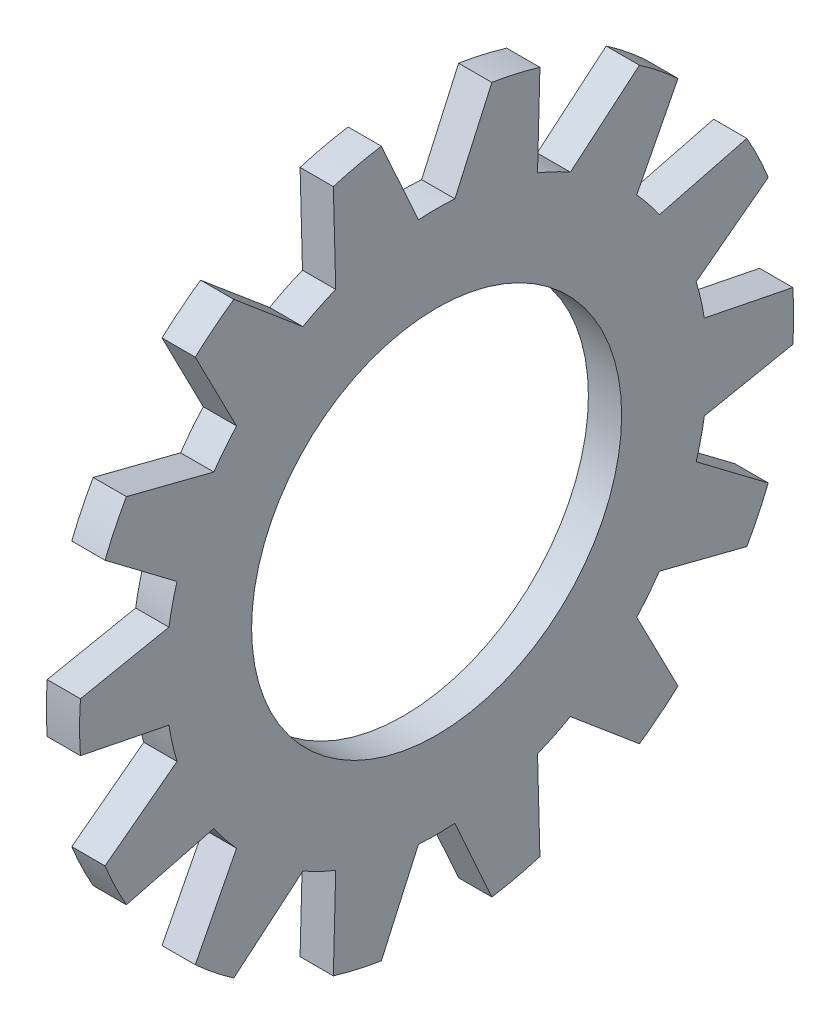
ISO-10303-21;
HEADER;
FILE_DESCRIPTION(('STEP AP214'),'2;1');
FILE_NAME('part.step','',(''),(''),'','','');
FILE_SCHEMA(('AUTOMOTIVE_DESIGN { 1 0 10303 214 1 1 1 1 }'));
ENDSEC;
DATA;
#1=APPLICATION_CONTEXT('core data for automotive mechanical design processes');
#2=APPLICATION_PROTOCOL_DEFINITION('international standard','automotive_design',2000,#1);
#3=PRODUCT_CONTEXT('',#1,'mechanical');
#4=PRODUCT('Part','Part','',(#3));
#5=PRODUCT_RELATED_PRODUCT_CATEGORY('part','',(#4));
#6=PRODUCT_DEFINITION_FORMATION('','',#4);
#7=PRODUCT_DEFINITION_CONTEXT('part definition',#1,'design');
#8=PRODUCT_DEFINITION('design','',#6,#7);
#9=PRODUCT_DEFINITION_SHAPE('','',#8);
#10=(LENGTH_UNIT() NAMED_UNIT(*) SI_UNIT(.MILLI.,.METRE.));
#11=(NAMED_UNIT(*) PLANE_ANGLE_UNIT() SI_UNIT($,.RADIAN.));
#12=(NAMED_UNIT(*) SI_UNIT($,.STERADIAN.) SOLID_ANGLE_UNIT());
#13=UNCERTAINTY_MEASURE_WITH_UNIT(LENGTH_MEASURE(1.E-05),#10,'distance_accuracy_value','');
#14=(GEOMETRIC_REPRESENTATION_CONTEXT(3) GLOBAL_UNCERTAINTY_ASSIGNED_CONTEXT((#13)) GLOBAL_UNIT_ASSIGNED_CONTEXT((#10,
#11,#12)) REPRESENTATION_CONTEXT('',''));
#15=CARTESIAN_POINT('',(0.,0.,0.));
#16=DIRECTION('',(0.,0.,1.));
#17=DIRECTION('',(1.,0.,0.));
#18=AXIS2_PLACEMENT_3D('',#15,#16,#17);
#19=CARTESIAN_POINT('',(-34.9249999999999,0.,0.));
#20=DIRECTION('',(-1.,0.,0.));
#21=DIRECTION('',(0.,0.,1.));
#22=AXIS2_PLACEMENT_3D('',#19,#20,#21);
#23=CYLINDRICAL_SURFACE('',#22,6.2738);
#24=CARTESIAN_POINT('',(-0.5842,0.,0.));
#25=DIRECTION('',(-1.,0.,0.));
#26=DIRECTION('',(0.,0.,1.));
#27=AXIS2_PLACEMENT_3D('',#24,#25,#26);
#28=CIRCLE('',#27,6.2738);
#29=CARTESIAN_POINT('',(-0.5842,4.62325554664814,4.24099924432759));
#30=VERTEX_POINT('',#29);
#31=CARTESIAN_POINT('',(-0.5842,5.16343968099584,3.56362976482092));
#32=VERTEX_POINT('',#31);
#33=EDGE_CURVE('E742',#30,#32,#28,.T.);
#34=ORIENTED_EDGE('',*,*,#33,.F.);
#35=DIRECTION('',(-1.,0.,0.));
#36=VECTOR('',#35,1.);
#37=CARTESIAN_POINT('',(-34.9249999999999,4.62325554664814,4.24099924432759));
#38=LINE('',#37,#36);
#39=CARTESIAN_POINT('',(0.,4.62325554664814,4.24099924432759));
#40=VERTEX_POINT('',#39);
#41=EDGE_CURVE('E408',#30,#40,#38,.F.);
#42=ORIENTED_EDGE('',*,*,#41,.T.);
#43=CARTESIAN_POINT('',(0.,0.,0.));
#44=DIRECTION('',(-1.,0.,0.));
#45=DIRECTION('',(0.,0.,1.));
#46=AXIS2_PLACEMENT_3D('',#43,#44,#45);
#47=CIRCLE('',#46,6.2738);
#48=CARTESIAN_POINT('',(0.,5.16343968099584,3.56362976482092));
#49=VERTEX_POINT('',#48);
#50=EDGE_CURVE('E747',#40,#49,#47,.T.);
#51=ORIENTED_EDGE('',*,*,#50,.T.);
#52=DIRECTION('',(-1.,0.,0.));
#53=VECTOR('',#52,1.);
#54=CARTESIAN_POINT('',(-34.9249999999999,5.16343968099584,3.56362976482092));
#55=LINE('',#54,#53);
#56=EDGE_CURVE('E699',#49,#32,#55,.T.);
#57=ORIENTED_EDGE('',*,*,#56,.T.);
#58=EDGE_LOOP('',(#34,#42,#51,#57));
#59=FACE_BOUND('',#58,.T.);
#60=ADVANCED_FACE('F39',(#59),#23,.T.);
#61=CARTESIAN_POINT('',(0.,2.32530870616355,5.82696369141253));
#62=VERTEX_POINT('',#61);
#63=CARTESIAN_POINT('',(0.,3.10589739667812,5.45105199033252));
#64=VERTEX_POINT('',#63);
#65=EDGE_CURVE('E796',#62,#64,#47,.T.);
#66=ORIENTED_EDGE('',*,*,#65,.T.);
#67=DIRECTION('',(-1.,0.,0.));
#68=VECTOR('',#67,1.);
#69=CARTESIAN_POINT('',(-34.9249999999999,3.10589739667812,5.45105199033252));
#70=LINE('',#69,#68);
#71=CARTESIAN_POINT('',(-0.5842,3.10589739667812,5.45105199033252));
#72=VERTEX_POINT('',#71);
#73=EDGE_CURVE('E676',#64,#72,#70,.T.);
#74=ORIENTED_EDGE('',*,*,#73,.T.);
#75=CARTESIAN_POINT('',(-0.5842,2.32530870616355,5.82696369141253));
#76=VERTEX_POINT('',#75);
#77=EDGE_CURVE('E867',#76,#72,#28,.T.);
#78=ORIENTED_EDGE('',*,*,#77,.F.);
#79=DIRECTION('',(-1.,0.,0.));
#80=VECTOR('',#79,1.);
#81=CARTESIAN_POINT('',(-34.9249999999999,2.32530870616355,5.82696369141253));
#82=LINE('',#81,#80);
#83=EDGE_CURVE('E680',#76,#62,#82,.F.);
#84=ORIENTED_EDGE('',*,*,#83,.T.);
#85=EDGE_LOOP('',(#66,#74,#78,#84));
#86=FACE_BOUND('',#85,.T.);
#87=ADVANCED_FACE('F922',(#86),#23,.T.);
#88=CARTESIAN_POINT('',(0.,-0.433194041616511,6.2588265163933));
#89=VERTEX_POINT('',#88);
#90=CARTESIAN_POINT('',(0.,0.433194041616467,6.25882651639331));
#91=VERTEX_POINT('',#90);
#92=EDGE_CURVE('E798',#89,#91,#47,.T.);
#93=ORIENTED_EDGE('',*,*,#92,.T.);
#94=DIRECTION('',(-1.,0.,0.));
#95=VECTOR('',#94,1.);
#96=CARTESIAN_POINT('',(-34.9249999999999,0.433194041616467,6.25882651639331));
#97=LINE('',#96,#95);
#98=CARTESIAN_POINT('',(-0.5842,0.433194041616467,6.25882651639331));
#99=VERTEX_POINT('',#98);
#100=EDGE_CURVE('E671',#91,#99,#97,.T.);
#101=ORIENTED_EDGE('',*,*,#100,.T.);
#102=CARTESIAN_POINT('',(-0.5842,-0.433194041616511,6.25882651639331));
#103=VERTEX_POINT('',#102);
#104=EDGE_CURVE('E788',#103,#99,#28,.T.);
#105=ORIENTED_EDGE('',*,*,#104,.F.);
#106=DIRECTION('',(-1.,0.,0.));
#107=VECTOR('',#106,1.);
#108=CARTESIAN_POINT('',(-34.9249999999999,-0.433194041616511,6.25882651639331));
#109=LINE('',#108,#107);
#110=EDGE_CURVE('E672',#103,#89,#109,.F.);
#111=ORIENTED_EDGE('',*,*,#110,.T.);
#112=EDGE_LOOP('',(#93,#101,#105,#111));
#113=FACE_BOUND('',#112,.T.);
#114=ADVANCED_FACE('F794',(#113),#23,.T.);
#115=CARTESIAN_POINT('',(-0.5842,-6.19829941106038,0.970386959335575));
#116=VERTEX_POINT('',#115);
#117=CARTESIAN_POINT('',(-0.5842,-6.00550992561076,1.81505288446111));
#118=VERTEX_POINT('',#117);
#119=EDGE_CURVE('E864',#116,#118,#28,.T.);
#120=ORIENTED_EDGE('',*,*,#119,.F.);
#121=DIRECTION('',(-1.,0.,0.));
#122=VECTOR('',#121,1.);
#123=CARTESIAN_POINT('',(-34.9249999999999,-6.19829941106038,0.970386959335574));
#124=LINE('',#123,#122);
#125=CARTESIAN_POINT('',(0.,-6.19829941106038,0.970386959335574));
#126=VERTEX_POINT('',#125);
#127=EDGE_CURVE('E663',#116,#126,#124,.F.);
#128=ORIENTED_EDGE('',*,*,#127,.T.);
#129=CARTESIAN_POINT('',(0.,-6.00550992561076,1.81505288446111));
#130=VERTEX_POINT('',#129);
#131=EDGE_CURVE('E832',#126,#130,#47,.T.);
#132=ORIENTED_EDGE('',*,*,#131,.T.);
#133=DIRECTION('',(-1.,0.,0.));
#134=VECTOR('',#133,1.);
#135=CARTESIAN_POINT('',(-34.9249999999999,-6.00550992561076,1.81505288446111));
#136=LINE('',#135,#134);
#137=EDGE_CURVE('E657',#130,#118,#136,.T.);
#138=ORIENTED_EDGE('',*,*,#137,.T.);
#139=EDGE_LOOP('',(#120,#128,#132,#138));
#140=FACE_BOUND('',#139,.T.);
#141=ADVANCED_FACE('F902',(#140),#23,.T.);
#142=CARTESIAN_POINT('',(-0.5842,-5.16343968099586,3.56362976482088));
#143=VERTEX_POINT('',#142);
#144=CARTESIAN_POINT('',(-0.5842,-4.62325554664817,4.24099924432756));
#145=VERTEX_POINT('',#144);
#146=EDGE_CURVE('E858',#143,#145,#28,.T.);
#147=ORIENTED_EDGE('',*,*,#146,.F.);
#148=DIRECTION('',(-1.,0.,0.));
#149=VECTOR('',#148,1.);
#150=CARTESIAN_POINT('',(-34.9249999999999,-5.16343968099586,3.56362976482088));
#151=LINE('',#150,#149);
#152=CARTESIAN_POINT('',(0.,-5.16343968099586,3.56362976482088));
#153=VERTEX_POINT('',#152);
#154=EDGE_CURVE('E659',#143,#153,#151,.F.);
#155=ORIENTED_EDGE('',*,*,#154,.T.);
#156=CARTESIAN_POINT('',(0.,-4.62325554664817,4.24099924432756));
#157=VERTEX_POINT('',#156);
#158=EDGE_CURVE('E805',#153,#157,#47,.T.);
#159=ORIENTED_EDGE('',*,*,#158,.T.);
#160=DIRECTION('',(-1.,0.,0.));
#161=VECTOR('',#160,1.);
#162=CARTESIAN_POINT('',(-34.9249999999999,-4.62325554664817,4.24099924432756));
#163=LINE('',#162,#161);
#164=EDGE_CURVE('E646',#157,#145,#163,.T.);
#165=ORIENTED_EDGE('',*,*,#164,.T.);
#166=EDGE_LOOP('',(#147,#155,#159,#165));
#167=FACE_BOUND('',#166,.T.);
#168=ADVANCED_FACE('F842',(#167),#23,.T.);
#169=CARTESIAN_POINT('',(0.,-3.10589739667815,5.4510519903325));
#170=VERTEX_POINT('',#169);
#171=CARTESIAN_POINT('',(0.,-2.32530870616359,5.82696369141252));
#172=VERTEX_POINT('',#171);
#173=EDGE_CURVE('E800',#170,#172,#47,.T.);
#174=ORIENTED_EDGE('',*,*,#173,.T.);
#175=DIRECTION('',(-1.,0.,0.));
#176=VECTOR('',#175,1.);
#177=CARTESIAN_POINT('',(-34.9249999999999,-2.32530870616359,5.82696369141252));
#178=LINE('',#177,#176);
#179=CARTESIAN_POINT('',(-0.5842,-2.32530870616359,5.82696369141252));
#180=VERTEX_POINT('',#179);
#181=EDGE_CURVE('E667',#172,#180,#178,.T.);
#182=ORIENTED_EDGE('',*,*,#181,.T.);
#183=CARTESIAN_POINT('',(-0.5842,-3.10589739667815,5.4510519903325));
#184=VERTEX_POINT('',#183);
#185=EDGE_CURVE('E862',#184,#180,#28,.T.);
#186=ORIENTED_EDGE('',*,*,#185,.F.);
#187=DIRECTION('',(-1.,0.,0.));
#188=VECTOR('',#187,1.);
#189=CARTESIAN_POINT('',(-34.9249999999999,-3.10589739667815,5.4510519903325));
#190=LINE('',#189,#188);
#191=EDGE_CURVE('E654',#184,#170,#190,.F.);
#192=ORIENTED_EDGE('',*,*,#191,.T.);
#193=EDGE_LOOP('',(#174,#182,#186,#192));
#194=FACE_BOUND('',#193,.T.);
#195=ADVANCED_FACE('F1122',(#194),#23,.T.);
#196=CARTESIAN_POINT('',(-0.5842,-2.32530870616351,-5.82696369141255));
#197=VERTEX_POINT('',#196);
#198=CARTESIAN_POINT('',(-0.5842,-3.10589739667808,-5.45105199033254));
#199=VERTEX_POINT('',#198);
#200=EDGE_CURVE('E876',#197,#199,#28,.T.);
#201=ORIENTED_EDGE('',*,*,#200,.F.);
#202=DIRECTION('',(-1.,0.,0.));
#203=VECTOR('',#202,1.);
#204=CARTESIAN_POINT('',(-34.9249999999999,-2.32530870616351,-5.82696369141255));
#205=LINE('',#204,#203);
#206=CARTESIAN_POINT('',(0.,-2.32530870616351,-5.82696369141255));
#207=VERTEX_POINT('',#206);
#208=EDGE_CURVE('E649',#197,#207,#205,.F.);
#209=ORIENTED_EDGE('',*,*,#208,.T.);
#210=CARTESIAN_POINT('',(0.,-3.10589739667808,-5.45105199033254));
#211=VERTEX_POINT('',#210);
#212=EDGE_CURVE('E821',#207,#211,#47,.T.);
#213=ORIENTED_EDGE('',*,*,#212,.T.);
#214=DIRECTION('',(-1.,0.,0.));
#215=VECTOR('',#214,1.);
#216=CARTESIAN_POINT('',(-34.9249999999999,-3.10589739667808,-5.45105199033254));
#217=LINE('',#216,#215);
#218=EDGE_CURVE('E637',#211,#199,#217,.T.);
#219=ORIENTED_EDGE('',*,*,#218,.T.);
#220=EDGE_LOOP('',(#201,#209,#213,#219));
#221=FACE_BOUND('',#220,.T.);
#222=ADVANCED_FACE('F998',(#221),#23,.T.);
#223=CARTESIAN_POINT('',(-0.5842,-4.62325554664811,-4.24099924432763));
#224=VERTEX_POINT('',#223);
#225=CARTESIAN_POINT('',(-0.5842,-5.16343968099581,-3.56362976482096));
#226=VERTEX_POINT('',#225);
#227=EDGE_CURVE('E883',#224,#226,#28,.T.);
#228=ORIENTED_EDGE('',*,*,#227,.F.);
#229=DIRECTION('',(-1.,0.,0.));
#230=VECTOR('',#229,1.);
#231=CARTESIAN_POINT('',(-34.9249999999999,-4.62325554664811,-4.24099924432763));
#232=LINE('',#231,#230);
#233=CARTESIAN_POINT('',(0.,-4.62325554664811,-4.24099924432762));
#234=VERTEX_POINT('',#233);
#235=EDGE_CURVE('E642',#224,#234,#232,.F.);
#236=ORIENTED_EDGE('',*,*,#235,.T.);
#237=CARTESIAN_POINT('',(0.,-5.16343968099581,-3.56362976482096));
#238=VERTEX_POINT('',#237);
#239=EDGE_CURVE('E824',#234,#238,#47,.T.);
#240=ORIENTED_EDGE('',*,*,#239,.T.);
#241=DIRECTION('',(-1.,0.,0.));
#242=VECTOR('',#241,1.);
#243=CARTESIAN_POINT('',(-34.9249999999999,-5.16343968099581,-3.56362976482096));
#244=LINE('',#243,#242);
#245=EDGE_CURVE('E635',#238,#226,#244,.T.);
#246=ORIENTED_EDGE('',*,*,#245,.T.);
#247=EDGE_LOOP('',(#228,#236,#240,#246));
#248=FACE_BOUND('',#247,.T.);
#249=ADVANCED_FACE('F1013',(#248),#23,.T.);
#250=CARTESIAN_POINT('',(0.,-6.00550992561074,-1.8150528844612));
#251=VERTEX_POINT('',#250);
#252=CARTESIAN_POINT('',(0.,-6.19829941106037,-0.970386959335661));
#253=VERTEX_POINT('',#252);
#254=EDGE_CURVE('E827',#251,#253,#47,.T.);
#255=ORIENTED_EDGE('',*,*,#254,.T.);
#256=DIRECTION('',(-1.,0.,0.));
#257=VECTOR('',#256,1.);
#258=CARTESIAN_POINT('',(-34.9249999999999,-6.19829941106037,-0.970386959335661));
#259=LINE('',#258,#257);
#260=CARTESIAN_POINT('',(-0.5842,-6.19829941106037,-0.970386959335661));
#261=VERTEX_POINT('',#260);
#262=EDGE_CURVE('E665',#253,#261,#259,.T.);
#263=ORIENTED_EDGE('',*,*,#262,.T.);
#264=CARTESIAN_POINT('',(-0.5842,-6.00550992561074,-1.8150528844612));
#265=VERTEX_POINT('',#264);
#266=EDGE_CURVE('E861',#265,#261,#28,.T.);
#267=ORIENTED_EDGE('',*,*,#266,.F.);
#268=DIRECTION('',(-1.,0.,0.));
#269=VECTOR('',#268,1.);
#270=CARTESIAN_POINT('',(-34.9249999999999,-6.00550992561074,-1.8150528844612));
#271=LINE('',#270,#269);
#272=EDGE_CURVE('E634',#265,#251,#271,.F.);
#273=ORIENTED_EDGE('',*,*,#272,.T.);
#274=EDGE_LOOP('',(#255,#263,#267,#273));
#275=FACE_BOUND('',#274,.T.);
#276=ADVANCED_FACE('F888',(#275),#23,.T.);
#277=CARTESIAN_POINT('',(0.,0.433194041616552,-6.2588265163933));
#278=VERTEX_POINT('',#277);
#279=CARTESIAN_POINT('',(0.,-0.433194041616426,-6.25882651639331));
#280=VERTEX_POINT('',#279);
#281=EDGE_CURVE('E820',#278,#280,#47,.T.);
#282=ORIENTED_EDGE('',*,*,#281,.T.);
#283=DIRECTION('',(-1.,0.,0.));
#284=VECTOR('',#283,1.);
#285=CARTESIAN_POINT('',(-34.9249999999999,-0.433194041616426,-6.25882651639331));
#286=LINE('',#285,#284);
#287=CARTESIAN_POINT('',(-0.5842,-0.433194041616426,-6.25882651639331));
#288=VERTEX_POINT('',#287);
#289=EDGE_CURVE('E641',#280,#288,#286,.T.);
#290=ORIENTED_EDGE('',*,*,#289,.T.);
#291=CARTESIAN_POINT('',(-0.5842,0.433194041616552,-6.2588265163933));
#292=VERTEX_POINT('',#291);
#293=EDGE_CURVE('E871',#292,#288,#28,.T.);
#294=ORIENTED_EDGE('',*,*,#293,.F.);
#295=DIRECTION('',(-1.,0.,0.));
#296=VECTOR('',#295,1.);
#297=CARTESIAN_POINT('',(-34.9249999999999,0.433194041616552,-6.2588265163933));
#298=LINE('',#297,#296);
#299=EDGE_CURVE('E627',#292,#278,#298,.F.);
#300=ORIENTED_EDGE('',*,*,#299,.T.);
#301=EDGE_LOOP('',(#282,#290,#294,#300));
#302=FACE_BOUND('',#301,.T.);
#303=ADVANCED_FACE('F989',(#302),#23,.T.);
#304=CARTESIAN_POINT('',(-0.5842,5.16343968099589,-3.56362976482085));
#305=VERTEX_POINT('',#304);
#306=CARTESIAN_POINT('',(-0.5842,4.6232555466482,-4.24099924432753));
#307=VERTEX_POINT('',#306);
#308=EDGE_CURVE('E738',#305,#307,#28,.T.);
#309=ORIENTED_EDGE('',*,*,#308,.F.);
#310=DIRECTION('',(-1.,0.,0.));
#311=VECTOR('',#310,1.);
#312=CARTESIAN_POINT('',(-34.9249999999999,5.16343968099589,-3.56362976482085));
#313=LINE('',#312,#311);
#314=CARTESIAN_POINT('',(0.,5.16343968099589,-3.56362976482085));
#315=VERTEX_POINT('',#314);
#316=EDGE_CURVE('E621',#305,#315,#313,.F.);
#317=ORIENTED_EDGE('',*,*,#316,.T.);
#318=CARTESIAN_POINT('',(0.,4.6232555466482,-4.24099924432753));
#319=VERTEX_POINT('',#318);
#320=EDGE_CURVE('E748',#315,#319,#47,.T.);
#321=ORIENTED_EDGE('',*,*,#320,.T.);
#322=DIRECTION('',(-1.,0.,0.));
#323=VECTOR('',#322,1.);
#324=CARTESIAN_POINT('',(-34.9249999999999,4.6232555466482,-4.24099924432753));
#325=LINE('',#324,#323);
#326=EDGE_CURVE('E399',#319,#307,#325,.T.);
#327=ORIENTED_EDGE('',*,*,#326,.T.);
#328=EDGE_LOOP('',(#309,#317,#321,#327));
#329=FACE_BOUND('',#328,.T.);
#330=ADVANCED_FACE('F944',(#329),#23,.T.);
#331=CARTESIAN_POINT('',(0.,3.10589739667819,-5.45105199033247));
#332=VERTEX_POINT('',#331);
#333=CARTESIAN_POINT('',(0.,2.32530870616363,-5.8269636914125));
#334=VERTEX_POINT('',#333);
#335=EDGE_CURVE('E811',#332,#334,#47,.T.);
#336=ORIENTED_EDGE('',*,*,#335,.T.);
#337=DIRECTION('',(-1.,0.,0.));
#338=VECTOR('',#337,1.);
#339=CARTESIAN_POINT('',(-34.9249999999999,2.32530870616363,-5.8269636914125));
#340=LINE('',#339,#338);
#341=CARTESIAN_POINT('',(-0.5842,2.32530870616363,-5.8269636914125));
#342=VERTEX_POINT('',#341);
#343=EDGE_CURVE('E626',#334,#342,#340,.T.);
#344=ORIENTED_EDGE('',*,*,#343,.T.);
#345=CARTESIAN_POINT('',(-0.5842,3.10589739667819,-5.45105199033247));
#346=VERTEX_POINT('',#345);
#347=EDGE_CURVE('E875',#346,#342,#28,.T.);
#348=ORIENTED_EDGE('',*,*,#347,.F.);
#349=DIRECTION('',(-1.,0.,0.));
#350=VECTOR('',#349,1.);
#351=CARTESIAN_POINT('',(-34.9249999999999,3.10589739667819,-5.45105199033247));
#352=LINE('',#351,#350);
#353=EDGE_CURVE('E617',#346,#332,#352,.F.);
#354=ORIENTED_EDGE('',*,*,#353,.T.);
#355=EDGE_LOOP('',(#336,#344,#348,#354));
#356=FACE_BOUND('',#355,.T.);
#357=ADVANCED_FACE('F939',(#356),#23,.T.);
#358=CARTESIAN_POINT('',(-0.5842,6.00550992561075,1.81505288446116));
#359=VERTEX_POINT('',#358);
#360=CARTESIAN_POINT('',(-0.5842,6.19829941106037,0.970386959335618));
#361=VERTEX_POINT('',#360);
#362=EDGE_CURVE('E731',#359,#361,#28,.T.);
#363=ORIENTED_EDGE('',*,*,#362,.F.);
#364=DIRECTION('',(-1.,0.,0.));
#365=VECTOR('',#364,1.);
#366=CARTESIAN_POINT('',(-34.9249999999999,6.00550992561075,1.81505288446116));
#367=LINE('',#366,#365);
#368=CARTESIAN_POINT('',(0.,6.00550992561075,1.81505288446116));
#369=VERTEX_POINT('',#368);
#370=EDGE_CURVE('E704',#359,#369,#367,.F.);
#371=ORIENTED_EDGE('',*,*,#370,.T.);
#372=CARTESIAN_POINT('',(0.,6.19829941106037,0.970386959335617));
#373=VERTEX_POINT('',#372);
#374=EDGE_CURVE('E736',#369,#373,#47,.T.);
#375=ORIENTED_EDGE('',*,*,#374,.T.);
#376=DIRECTION('',(-1.,0.,0.));
#377=VECTOR('',#376,1.);
#378=CARTESIAN_POINT('',(-34.9249999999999,6.19829941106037,0.970386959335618));
#379=LINE('',#378,#377);
#380=EDGE_CURVE('E724',#373,#361,#379,.T.);
#381=ORIENTED_EDGE('',*,*,#380,.T.);
#382=EDGE_LOOP('',(#363,#371,#375,#381));
#383=FACE_BOUND('',#382,.T.);
#384=ADVANCED_FACE('F932',(#383),#23,.T.);
#385=CARTESIAN_POINT('',(-34.9249999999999,0.,0.));
#386=DIRECTION('',(-1.,0.,0.));
#387=DIRECTION('',(0.,0.,1.));
#388=AXIS2_PLACEMENT_3D('',#385,#386,#387);
#389=CYLINDRICAL_SURFACE('',#388,3.2512);
#390=CARTESIAN_POINT('',(0.,0.,0.));
#391=DIRECTION('',(-1.,0.,0.));
#392=DIRECTION('',(0.,0.,1.));
#393=AXIS2_PLACEMENT_3D('',#390,#391,#392);
#394=CIRCLE('',#393,3.2512);
#395=CARTESIAN_POINT('',(0.,0.,3.2512));
#396=VERTEX_POINT('',#395);
#397=EDGE_CURVE('E741',#396,#396,#394,.T.);
#398=ORIENTED_EDGE('',*,*,#397,.F.);
#399=EDGE_LOOP('',(#398));
#400=FACE_BOUND('',#399,.T.);
#401=CARTESIAN_POINT('',(-0.5842,0.,0.));
#402=DIRECTION('',(-1.,0.,0.));
#403=DIRECTION('',(0.,0.,1.));
#404=AXIS2_PLACEMENT_3D('',#401,#402,#403);
#405=CIRCLE('',#404,3.2512);
#406=CARTESIAN_POINT('',(-0.5842,0.,3.2512));
#407=VERTEX_POINT('',#406);
#408=EDGE_CURVE('E734',#407,#407,#405,.T.);
#409=ORIENTED_EDGE('',*,*,#408,.T.);
#410=EDGE_LOOP('',(#409));
#411=FACE_BOUND('',#410,.T.);
#412=ADVANCED_FACE('F41',(#400,#411),#389,.F.);
#413=CARTESIAN_POINT('',(0.,3.2512,0.));
#414=DIRECTION('',(-1.,0.,0.));
#415=DIRECTION('',(0.,0.,1.));
#416=AXIS2_PLACEMENT_3D('',#413,#414,#415);
#417=PLANE('',#416);
#418=ORIENTED_EDGE('',*,*,#50,.F.);
#419=DIRECTION('',(0.,0.889161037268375,0.457594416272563));
#420=VECTOR('',#419,1.);
#421=CARTESIAN_POINT('',(0.,4.9119103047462,4.38955141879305));
#422=LINE('',#421,#420);
#423=CARTESIAN_POINT('',(0.,3.2131184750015,3.51529172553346));
#424=VERTEX_POINT('',#423);
#425=EDGE_CURVE('E415',#424,#40,#422,.T.);
#426=ORIENTED_EDGE('',*,*,#425,.F.);
#427=CARTESIAN_POINT('',(0.,0.,0.));
#428=DIRECTION('',(-1.,0.,0.));
#429=DIRECTION('',(0.,0.781831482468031,-0.623489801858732));
#430=AXIS2_PLACEMENT_3D('',#427,#428,#429);
#431=CIRCLE('',#430,4.7625);
#432=CARTESIAN_POINT('',(0.,2.71216989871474,3.91478488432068));
#433=VERTEX_POINT('',#432);
#434=EDGE_CURVE('E397',#433,#424,#431,.T.);
#435=ORIENTED_EDGE('',*,*,#434,.F.);
#436=DIRECTION('',(0.,-0.248264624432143,-0.968692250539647));
#437=VECTOR('',#436,1.);
#438=CARTESIAN_POINT('',(0.,3.18649333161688,5.7655255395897));
#439=LINE('',#438,#437);
#440=EDGE_CURVE('E417',#64,#433,#439,.T.);
#441=ORIENTED_EDGE('',*,*,#440,.F.);
#442=ORIENTED_EDGE('',*,*,#65,.F.);
#443=DIRECTION('',(0.,0.602563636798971,0.798070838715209));
#444=VECTOR('',#443,1.);
#445=CARTESIAN_POINT('',(0.,2.52092328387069,6.08604718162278));
#446=LINE('',#445,#444);
#447=CARTESIAN_POINT('',(0.,1.36969179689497,4.56128826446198));
#448=VERTEX_POINT('',#447);
#449=EDGE_CURVE('E421',#448,#62,#446,.T.);
#450=ORIENTED_EDGE('',*,*,#449,.F.);
#451=CARTESIAN_POINT('',(0.,0.,0.));
#452=DIRECTION('',(-1.,0.,0.));
#453=DIRECTION('',(0.,0.974927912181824,-0.222520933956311));
#454=AXIS2_PLACEMENT_3D('',#451,#452,#453);
#455=CIRCLE('',#454,4.7625);
#456=CARTESIAN_POINT('',(0.,0.745019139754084,4.70386572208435));
#457=VERTEX_POINT('',#456);
#458=EDGE_CURVE('E429',#457,#448,#455,.T.);
#459=ORIENTED_EDGE('',*,*,#458,.F.);
#460=DIRECTION('',(0.,0.196621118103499,-0.980479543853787));
#461=VECTOR('',#460,1.);
#462=CARTESIAN_POINT('',(0.,0.369363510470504,6.57712665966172));
#463=LINE('',#462,#461);
#464=EDGE_CURVE('E430',#91,#457,#463,.T.);
#465=ORIENTED_EDGE('',*,*,#464,.F.);
#466=ORIENTED_EDGE('',*,*,#92,.F.);
#467=DIRECTION('',(0.,0.196621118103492,0.980479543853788));
#468=VECTOR('',#467,1.);
#469=CARTESIAN_POINT('',(0.,-0.36936351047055,6.57712665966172));
#470=LINE('',#469,#468);
#471=CARTESIAN_POINT('',(0.,-0.745019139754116,4.70386572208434));
#472=VERTEX_POINT('',#471);
#473=EDGE_CURVE('E439',#472,#89,#470,.T.);
#474=ORIENTED_EDGE('',*,*,#473,.F.);
#475=CARTESIAN_POINT('',(0.,0.,0.));
#476=DIRECTION('',(-1.,0.,0.));
#477=DIRECTION('',(0.,0.974927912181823,0.222520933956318));
#478=AXIS2_PLACEMENT_3D('',#475,#476,#477);
#479=CIRCLE('',#478,4.7625);
#480=CARTESIAN_POINT('',(0.,-1.369691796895,4.56128826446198));
#481=VERTEX_POINT('',#480);
#482=EDGE_CURVE('E447',#481,#472,#479,.T.);
#483=ORIENTED_EDGE('',*,*,#482,.F.);
#484=DIRECTION('',(0.,0.602563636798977,-0.798070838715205));
#485=VECTOR('',#484,1.);
#486=CARTESIAN_POINT('',(0.,-2.52092328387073,6.08604718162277));
#487=LINE('',#486,#485);
#488=EDGE_CURVE('E443',#172,#481,#487,.T.);
#489=ORIENTED_EDGE('',*,*,#488,.F.);
#490=ORIENTED_EDGE('',*,*,#173,.F.);
#491=DIRECTION('',(0.,-0.248264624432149,0.968692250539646));
#492=VECTOR('',#491,1.);
#493=CARTESIAN_POINT('',(0.,-3.18649333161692,5.76552553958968));
#494=LINE('',#493,#492);
#495=CARTESIAN_POINT('',(0.,-2.71216989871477,3.91478488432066));
#496=VERTEX_POINT('',#495);
#497=EDGE_CURVE('E496',#496,#170,#494,.T.);
#498=ORIENTED_EDGE('',*,*,#497,.F.);
#499=CARTESIAN_POINT('',(0.,0.,0.));
#500=DIRECTION('',(-1.,0.,0.));
#501=DIRECTION('',(0.,0.781831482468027,0.623489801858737));
#502=AXIS2_PLACEMENT_3D('',#499,#500,#501);
#503=CIRCLE('',#502,4.7625);
#504=CARTESIAN_POINT('',(0.,-3.21311847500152,3.51529172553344));
#505=VERTEX_POINT('',#504);
#506=EDGE_CURVE('E501',#505,#496,#503,.T.);
#507=ORIENTED_EDGE('',*,*,#506,.F.);
#508=DIRECTION('',(0.,0.889161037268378,-0.457594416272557));
#509=VECTOR('',#508,1.);
#510=CARTESIAN_POINT('',(0.,-4.91191030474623,4.38955141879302));
#511=LINE('',#510,#509);
#512=EDGE_CURVE('E473',#157,#505,#511,.T.);
#513=ORIENTED_EDGE('',*,*,#512,.F.);
#514=ORIENTED_EDGE('',*,*,#158,.F.);
#515=DIRECTION('',(0.,-0.643978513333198,0.765043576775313));
#516=VECTOR('',#515,1.);
#517=CARTESIAN_POINT('',(0.,-5.37249906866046,3.81199137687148));
#518=LINE('',#517,#516);
#519=CARTESIAN_POINT('',(0.,-4.14214214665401,2.35033288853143));
#520=VERTEX_POINT('',#519);
#521=EDGE_CURVE('E459',#520,#153,#518,.T.);
#522=ORIENTED_EDGE('',*,*,#521,.F.);
#523=CARTESIAN_POINT('',(0.,0.,0.));
#524=DIRECTION('',(-1.,0.,0.));
#525=DIRECTION('',(0.,0.433883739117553,0.900968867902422));
#526=AXIS2_PLACEMENT_3D('',#523,#524,#525);
#527=CIRCLE('',#526,4.7625);
#528=CARTESIAN_POINT('',(0.,-4.42014763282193,1.77304854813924));
#529=VERTEX_POINT('',#528);
#530=EDGE_CURVE('E464',#529,#520,#527,.T.);
#531=ORIENTED_EDGE('',*,*,#530,.F.);
#532=DIRECTION('',(0.,0.999649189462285,-0.0264858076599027));
#533=VECTOR('',#532,1.);
#534=CARTESIAN_POINT('',(0.,-6.33003324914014,1.82365116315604));
#535=LINE('',#534,#533);
#536=EDGE_CURVE('E465',#130,#529,#535,.T.);
#537=ORIENTED_EDGE('',*,*,#536,.F.);
#538=ORIENTED_EDGE('',*,*,#131,.F.);
#539=DIRECTION('',(0.,-0.912144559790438,0.409868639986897));
#540=VECTOR('',#539,1.);
#541=CARTESIAN_POINT('',(0.,-6.4944154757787,1.10344557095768));
#542=LINE('',#541,#540);
#543=CARTESIAN_POINT('',(0.,-4.75171234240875,0.320368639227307));
#544=VERTEX_POINT('',#543);
#545=EDGE_CURVE('E479',#544,#126,#542,.T.);
#546=ORIENTED_EDGE('',*,*,#545,.F.);
#547=CARTESIAN_POINT('',(0.,0.,0.));
#548=DIRECTION('',(-1.,0.,0.));
#549=DIRECTION('',(0.,0.,1.));
#550=AXIS2_PLACEMENT_3D('',#547,#548,#549);
#551=CIRCLE('',#550,4.7625);
#552=CARTESIAN_POINT('',(0.,-4.75171234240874,-0.320368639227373));
#553=VERTEX_POINT('',#552);
#554=EDGE_CURVE('E484',#553,#544,#551,.T.);
#555=ORIENTED_EDGE('',*,*,#554,.F.);
#556=DIRECTION('',(0.,0.912144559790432,0.409868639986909));
#557=VECTOR('',#556,1.);
#558=CARTESIAN_POINT('',(0.,-6.49441547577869,-1.10344557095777));
#559=LINE('',#558,#557);
#560=EDGE_CURVE('E485',#253,#553,#559,.T.);
#561=ORIENTED_EDGE('',*,*,#560,.F.);
#562=ORIENTED_EDGE('',*,*,#254,.F.);
#563=DIRECTION('',(0.,-0.999649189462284,-0.0264858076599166));
#564=VECTOR('',#563,1.);
#565=CARTESIAN_POINT('',(0.,-6.33003324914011,-1.82365116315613));
#566=LINE('',#565,#564);
#567=CARTESIAN_POINT('',(0.,-4.42014763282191,-1.7730485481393));
#568=VERTEX_POINT('',#567);
#569=EDGE_CURVE('E546',#568,#251,#566,.T.);
#570=ORIENTED_EDGE('',*,*,#569,.F.);
#571=CARTESIAN_POINT('',(0.,0.,0.));
#572=DIRECTION('',(-1.,0.,0.));
#573=DIRECTION('',(0.,-0.433883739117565,0.900968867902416));
#574=AXIS2_PLACEMENT_3D('',#571,#572,#573);
#575=CIRCLE('',#574,4.7625);
#576=CARTESIAN_POINT('',(0.,-4.14214214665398,-2.35033288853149));
#577=VERTEX_POINT('',#576);
#578=EDGE_CURVE('E554',#577,#568,#575,.T.);
#579=ORIENTED_EDGE('',*,*,#578,.F.);
#580=DIRECTION('',(0.,0.643978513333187,0.765043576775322));
#581=VECTOR('',#580,1.);
#582=CARTESIAN_POINT('',(0.,-5.3724990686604,-3.81199137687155));
#583=LINE('',#582,#581);
#584=EDGE_CURVE('E523',#238,#577,#583,.T.);
#585=ORIENTED_EDGE('',*,*,#584,.F.);
#586=ORIENTED_EDGE('',*,*,#239,.F.);
#587=DIRECTION('',(0.,-0.889161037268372,-0.457594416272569));
#588=VECTOR('',#587,1.);
#589=CARTESIAN_POINT('',(0.,-4.91191030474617,-4.38955141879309));
#590=LINE('',#589,#588);
#591=CARTESIAN_POINT('',(0.,-3.21311847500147,-3.51529172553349));
#592=VERTEX_POINT('',#591);
#593=EDGE_CURVE('E515',#592,#234,#590,.T.);
#594=ORIENTED_EDGE('',*,*,#593,.F.);
#595=CARTESIAN_POINT('',(0.,0.,0.));
#596=DIRECTION('',(-1.,0.,0.));
#597=DIRECTION('',(0.,-0.781831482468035,0.623489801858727));
#598=AXIS2_PLACEMENT_3D('',#595,#596,#597);
#599=CIRCLE('',#598,4.7625);
#600=CARTESIAN_POINT('',(0.,-2.71216989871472,-3.91478488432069));
#601=VERTEX_POINT('',#600);
#602=EDGE_CURVE('E517',#601,#592,#599,.T.);
#603=ORIENTED_EDGE('',*,*,#602,.F.);
#604=DIRECTION('',(0.,0.248264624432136,0.968692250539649));
#605=VECTOR('',#604,1.);
#606=CARTESIAN_POINT('',(0.,-3.18649333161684,-5.76552553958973));
#607=LINE('',#606,#605);
#608=EDGE_CURVE('E518',#211,#601,#607,.T.);
#609=ORIENTED_EDGE('',*,*,#608,.F.);
#610=ORIENTED_EDGE('',*,*,#212,.F.);
#611=DIRECTION('',(0.,-0.602563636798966,-0.798070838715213));
#612=VECTOR('',#611,1.);
#613=CARTESIAN_POINT('',(0.,-2.52092328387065,-6.0860471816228));
#614=LINE('',#613,#612);
#615=CARTESIAN_POINT('',(0.,-1.36969179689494,-4.56128826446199));
#616=VERTEX_POINT('',#615);
#617=EDGE_CURVE('E535',#616,#207,#614,.T.);
#618=ORIENTED_EDGE('',*,*,#617,.F.);
#619=CARTESIAN_POINT('',(0.,0.,0.));
#620=DIRECTION('',(-1.,0.,0.));
#621=DIRECTION('',(0.,-0.974927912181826,0.222520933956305));
#622=AXIS2_PLACEMENT_3D('',#619,#620,#621);
#623=CIRCLE('',#622,4.7625);
#624=CARTESIAN_POINT('',(0.,-0.745019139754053,-4.70386572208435));
#625=VERTEX_POINT('',#624);
#626=EDGE_CURVE('E537',#625,#616,#623,.T.);
#627=ORIENTED_EDGE('',*,*,#626,.F.);
#628=DIRECTION('',(0.,-0.196621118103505,0.980479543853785));
#629=VECTOR('',#628,1.);
#630=CARTESIAN_POINT('',(0.,-0.369363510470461,-6.57712665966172));
#631=LINE('',#630,#629);
#632=EDGE_CURVE('E538',#280,#625,#631,.T.);
#633=ORIENTED_EDGE('',*,*,#632,.F.);
#634=ORIENTED_EDGE('',*,*,#281,.F.);
#635=DIRECTION('',(0.,-0.196621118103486,-0.980479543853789));
#636=VECTOR('',#635,1.);
#637=CARTESIAN_POINT('',(0.,0.369363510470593,-6.57712665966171));
#638=LINE('',#637,#636);
#639=CARTESIAN_POINT('',(0.,0.745019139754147,-4.70386572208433));
#640=VERTEX_POINT('',#639);
#641=EDGE_CURVE('E566',#640,#278,#638,.T.);
#642=ORIENTED_EDGE('',*,*,#641,.F.);
#643=CARTESIAN_POINT('',(0.,0.,0.));
#644=DIRECTION('',(-1.,0.,0.));
#645=DIRECTION('',(0.,-0.974927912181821,-0.222520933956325));
#646=AXIS2_PLACEMENT_3D('',#643,#644,#645);
#647=CIRCLE('',#646,4.7625);
#648=CARTESIAN_POINT('',(0.,1.36969179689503,-4.56128826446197));
#649=VERTEX_POINT('',#648);
#650=EDGE_CURVE('E575',#649,#640,#647,.T.);
#651=ORIENTED_EDGE('',*,*,#650,.F.);
#652=DIRECTION('',(0.,-0.602563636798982,0.798070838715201));
#653=VECTOR('',#652,1.);
#654=CARTESIAN_POINT('',(0.,2.52092328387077,-6.08604718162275));
#655=LINE('',#654,#653);
#656=EDGE_CURVE('E569',#334,#649,#655,.T.);
#657=ORIENTED_EDGE('',*,*,#656,.F.);
#658=ORIENTED_EDGE('',*,*,#335,.F.);
#659=DIRECTION('',(0.,0.248264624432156,-0.968692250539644));
#660=VECTOR('',#659,1.);
#661=CARTESIAN_POINT('',(0.,3.18649333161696,-5.76552553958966));
#662=LINE('',#661,#660);
#663=CARTESIAN_POINT('',(0.,2.7121698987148,-3.91478488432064));
#664=VERTEX_POINT('',#663);
#665=EDGE_CURVE('E602',#664,#332,#662,.T.);
#666=ORIENTED_EDGE('',*,*,#665,.F.);
#667=CARTESIAN_POINT('',(0.,0.,0.));
#668=DIRECTION('',(-1.,0.,0.));
#669=DIRECTION('',(0.,-0.781831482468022,-0.623489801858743));
#670=AXIS2_PLACEMENT_3D('',#667,#668,#669);
#671=CIRCLE('',#670,4.7625);
#672=CARTESIAN_POINT('',(0.,3.21311847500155,-3.51529172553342));
#673=VERTEX_POINT('',#672);
#674=EDGE_CURVE('E609',#673,#664,#671,.T.);
#675=ORIENTED_EDGE('',*,*,#674,.F.);
#676=DIRECTION('',(0.,-0.889161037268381,0.457594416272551));
#677=VECTOR('',#676,1.);
#678=CARTESIAN_POINT('',(0.,4.91191030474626,-4.38955141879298));
#679=LINE('',#678,#677);
#680=EDGE_CURVE('E597',#319,#673,#679,.T.);
#681=ORIENTED_EDGE('',*,*,#680,.F.);
#682=ORIENTED_EDGE('',*,*,#320,.F.);
#683=DIRECTION('',(0.,0.643978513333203,-0.765043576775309));
#684=VECTOR('',#683,1.);
#685=CARTESIAN_POINT('',(0.,5.37249906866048,-3.81199137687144));
#686=LINE('',#685,#684);
#687=CARTESIAN_POINT('',(0.,4.14214214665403,-2.3503328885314));
#688=VERTEX_POINT('',#687);
#689=EDGE_CURVE('E585',#688,#315,#686,.T.);
#690=ORIENTED_EDGE('',*,*,#689,.F.);
#691=CARTESIAN_POINT('',(0.,0.,0.));
#692=DIRECTION('',(-1.,0.,0.));
#693=DIRECTION('',(0.,-0.433883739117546,-0.900968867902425));
#694=AXIS2_PLACEMENT_3D('',#691,#692,#693);
#695=CIRCLE('',#694,4.7625);
#696=CARTESIAN_POINT('',(0.,4.42014763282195,-1.7730485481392));
#697=VERTEX_POINT('',#696);
#698=EDGE_CURVE('E588',#697,#688,#695,.T.);
#699=ORIENTED_EDGE('',*,*,#698,.F.);
#700=DIRECTION('',(0.,-0.999649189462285,0.0264858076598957));
#701=VECTOR('',#700,1.);
#702=CARTESIAN_POINT('',(0.,6.33003324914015,-1.82365116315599));
#703=LINE('',#702,#701);
#704=CARTESIAN_POINT('',(0.,6.00550992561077,-1.81505288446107));
#705=VERTEX_POINT('',#704);
#706=EDGE_CURVE('E589',#705,#697,#703,.T.);
#707=ORIENTED_EDGE('',*,*,#706,.F.);
#708=CARTESIAN_POINT('',(0.,6.19829941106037,-0.970386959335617));
#709=VERTEX_POINT('',#708);
#710=EDGE_CURVE('E745',#709,#705,#47,.T.);
#711=ORIENTED_EDGE('',*,*,#710,.F.);
#712=DIRECTION('',(0.,0.912144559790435,-0.409868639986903));
#713=VECTOR('',#712,1.);
#714=CARTESIAN_POINT('',(0.,6.49441547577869,-1.10344557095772));
#715=LINE('',#714,#713);
#716=CARTESIAN_POINT('',(0.,4.75171234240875,-0.32036863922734));
#717=VERTEX_POINT('',#716);
#718=EDGE_CURVE('E712',#717,#709,#715,.T.);
#719=ORIENTED_EDGE('',*,*,#718,.F.);
#720=CARTESIAN_POINT('',(0.,0.,0.));
#721=DIRECTION('',(-1.,0.,0.));
#722=DIRECTION('',(0.,0.,-1.));
#723=AXIS2_PLACEMENT_3D('',#720,#721,#722);
#724=CIRCLE('',#723,4.7625);
#725=CARTESIAN_POINT('',(0.,4.75171234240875,0.32036863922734));
#726=VERTEX_POINT('',#725);
#727=EDGE_CURVE('E719',#726,#717,#724,.T.);
#728=ORIENTED_EDGE('',*,*,#727,.F.);
#729=DIRECTION('',(0.,-0.912144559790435,-0.409868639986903));
#730=VECTOR('',#729,1.);
#731=CARTESIAN_POINT('',(0.,6.49441547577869,1.10344557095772));
#732=LINE('',#731,#730);
#733=EDGE_CURVE('E709',#373,#726,#732,.T.);
#734=ORIENTED_EDGE('',*,*,#733,.F.);
#735=ORIENTED_EDGE('',*,*,#374,.F.);
#736=DIRECTION('',(0.,0.999649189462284,0.0264858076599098));
#737=VECTOR('',#736,1.);
#738=CARTESIAN_POINT('',(0.,6.33003324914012,1.82365116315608));
#739=LINE('',#738,#737);
#740=CARTESIAN_POINT('',(0.,4.42014763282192,1.77304854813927));
#741=VERTEX_POINT('',#740);
#742=EDGE_CURVE('E689',#741,#369,#739,.T.);
#743=ORIENTED_EDGE('',*,*,#742,.F.);
#744=CARTESIAN_POINT('',(0.,0.,0.));
#745=DIRECTION('',(-1.,0.,0.));
#746=DIRECTION('',(0.,0.433883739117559,-0.900968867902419));
#747=AXIS2_PLACEMENT_3D('',#744,#745,#746);
#748=CIRCLE('',#747,4.7625);
#749=CARTESIAN_POINT('',(0.,4.142142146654,2.35033288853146));
#750=VERTEX_POINT('',#749);
#751=EDGE_CURVE('E692',#750,#741,#748,.T.);
#752=ORIENTED_EDGE('',*,*,#751,.F.);
#753=DIRECTION('',(0.,-0.643978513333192,-0.765043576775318));
#754=VECTOR('',#753,1.);
#755=CARTESIAN_POINT('',(0.,5.37249906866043,3.81199137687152));
#756=LINE('',#755,#754);
#757=EDGE_CURVE('E685',#49,#750,#756,.T.);
#758=ORIENTED_EDGE('',*,*,#757,.F.);
#759=EDGE_LOOP('',(#418,#426,#435,#441,#442,#450,#459,#465,#466,#474,#483,#489,#490,#498,#507,
#513,#514,#522,#531,#537,#538,#546,#555,#561,#562,#570,#579,#585,#586,#594,#603,#609,#610,#618,
#627,#633,#634,#642,#651,#657,#658,#666,#675,#681,#682,#690,#699,#707,#711,#719,#728,#734,#735,
#743,#752,#758));
#760=FACE_BOUND('',#759,.T.);
#761=ORIENTED_EDGE('',*,*,#397,.T.);
#762=EDGE_LOOP('',(#761));
#763=FACE_BOUND('',#762,.T.);
#764=ADVANCED_FACE('F850',(#760,#763),#417,.F.);
#765=ORIENTED_EDGE('',*,*,#710,.T.);
#766=DIRECTION('',(-1.,0.,0.));
#767=VECTOR('',#766,1.);
#768=CARTESIAN_POINT('',(-34.9249999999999,6.00550992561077,-1.81505288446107));
#769=LINE('',#768,#767);
#770=CARTESIAN_POINT('',(-0.5842,6.00550992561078,-1.81505288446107));
#771=VERTEX_POINT('',#770);
#772=EDGE_CURVE('E619',#705,#771,#769,.T.);
#773=ORIENTED_EDGE('',*,*,#772,.T.);
#774=CARTESIAN_POINT('',(-0.5842,6.19829941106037,-0.970386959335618));
#775=VERTEX_POINT('',#774);
#776=EDGE_CURVE('E737',#775,#771,#28,.T.);
#777=ORIENTED_EDGE('',*,*,#776,.F.);
#778=DIRECTION('',(-1.,0.,0.));
#779=VECTOR('',#778,1.);
#780=CARTESIAN_POINT('',(-34.9249999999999,6.19829941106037,-0.970386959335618));
#781=LINE('',#780,#779);
#782=EDGE_CURVE('E729',#775,#709,#781,.F.);
#783=ORIENTED_EDGE('',*,*,#782,.T.);
#784=EDGE_LOOP('',(#765,#773,#777,#783));
#785=FACE_BOUND('',#784,.T.);
#786=ADVANCED_FACE('F921',(#785),#23,.T.);
#787=CARTESIAN_POINT('',(-0.5842,6.2738,0.));
#788=DIRECTION('',(1.,0.,0.));
#789=DIRECTION('',(0.,0.,-1.));
#790=AXIS2_PLACEMENT_3D('',#787,#788,#789);
#791=PLANE('',#790);
#792=ORIENTED_EDGE('',*,*,#408,.F.);
#793=EDGE_LOOP('',(#792));
#794=FACE_BOUND('',#793,.T.);
#795=CARTESIAN_POINT('',(-0.5842,0.,0.));
#796=DIRECTION('',(-1.,0.,0.));
#797=DIRECTION('',(0.,0.781831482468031,-0.623489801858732));
#798=AXIS2_PLACEMENT_3D('',#795,#796,#797);
#799=CIRCLE('',#798,4.7625);
#800=CARTESIAN_POINT('',(-0.5842,2.71216989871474,3.91478488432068));
#801=VERTEX_POINT('',#800);
#802=CARTESIAN_POINT('',(-0.5842,3.2131184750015,3.51529172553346));
#803=VERTEX_POINT('',#802);
#804=EDGE_CURVE('E53',#801,#803,#799,.T.);
#805=ORIENTED_EDGE('',*,*,#804,.T.);
#806=DIRECTION('',(0.,0.889161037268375,0.457594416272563));
#807=VECTOR('',#806,1.);
#808=CARTESIAN_POINT('',(-0.5842,4.9119103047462,4.38955141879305));
#809=LINE('',#808,#807);
#810=EDGE_CURVE('E401',#803,#30,#809,.T.);
#811=ORIENTED_EDGE('',*,*,#810,.T.);
#812=ORIENTED_EDGE('',*,*,#33,.T.);
#813=DIRECTION('',(0.,-0.643978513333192,-0.765043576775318));
#814=VECTOR('',#813,1.);
#815=CARTESIAN_POINT('',(-0.5842,3.86821608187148,2.02490995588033));
#816=LINE('',#815,#814);
#817=CARTESIAN_POINT('',(-0.5842,4.142142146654,2.35033288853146));
#818=VERTEX_POINT('',#817);
#819=EDGE_CURVE('E751',#32,#818,#816,.T.);
#820=ORIENTED_EDGE('',*,*,#819,.T.);
#821=CARTESIAN_POINT('',(-0.5842,0.,0.));
#822=DIRECTION('',(-1.,0.,0.));
#823=DIRECTION('',(0.,0.433883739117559,-0.900968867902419));
#824=AXIS2_PLACEMENT_3D('',#821,#822,#823);
#825=CIRCLE('',#824,4.7625);
#826=CARTESIAN_POINT('',(-0.5842,4.42014763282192,1.77304854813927));
#827=VERTEX_POINT('',#826);
#828=EDGE_CURVE('E684',#818,#827,#825,.T.);
#829=ORIENTED_EDGE('',*,*,#828,.T.);
#830=DIRECTION('',(0.,0.999649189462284,0.0264858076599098));
#831=VECTOR('',#830,1.);
#832=CARTESIAN_POINT('',(-0.5842,6.33003324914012,1.82365116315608));
#833=LINE('',#832,#831);
#834=EDGE_CURVE('E686',#827,#359,#833,.T.);
#835=ORIENTED_EDGE('',*,*,#834,.T.);
#836=ORIENTED_EDGE('',*,*,#362,.T.);
#837=DIRECTION('',(0.,-0.912144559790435,-0.409868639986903));
#838=VECTOR('',#837,1.);
#839=CARTESIAN_POINT('',(-0.5842,5.89832814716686,0.835596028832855));
#840=LINE('',#839,#838);
#841=CARTESIAN_POINT('',(-0.5842,4.75171234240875,0.32036863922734));
#842=VERTEX_POINT('',#841);
#843=EDGE_CURVE('E749',#361,#842,#840,.T.);
#844=ORIENTED_EDGE('',*,*,#843,.T.);
#845=CARTESIAN_POINT('',(-0.5842,0.,0.));
#846=DIRECTION('',(-1.,0.,0.));
#847=DIRECTION('',(0.,0.,-1.));
#848=AXIS2_PLACEMENT_3D('',#845,#846,#847);
#849=CIRCLE('',#848,4.7625);
#850=CARTESIAN_POINT('',(-0.5842,4.75171234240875,-0.32036863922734));
#851=VERTEX_POINT('',#850);
#852=EDGE_CURVE('E706',#842,#851,#849,.T.);
#853=ORIENTED_EDGE('',*,*,#852,.T.);
#854=DIRECTION('',(0.,0.912144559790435,-0.409868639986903));
#855=VECTOR('',#854,1.);
#856=CARTESIAN_POINT('',(-0.5842,6.49441547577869,-1.10344557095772));
#857=LINE('',#856,#855);
#858=EDGE_CURVE('E714',#851,#775,#857,.T.);
#859=ORIENTED_EDGE('',*,*,#858,.T.);
#860=ORIENTED_EDGE('',*,*,#776,.T.);
#861=DIRECTION('',(0.,-0.999649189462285,0.0264858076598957));
#862=VECTOR('',#861,1.);
#863=CARTESIAN_POINT('',(-0.5842,6.22555551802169,-1.82088301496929));
#864=LINE('',#863,#862);
#865=CARTESIAN_POINT('',(-0.5842,4.42014763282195,-1.7730485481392));
#866=VERTEX_POINT('',#865);
#867=EDGE_CURVE('E757',#771,#866,#864,.T.);
#868=ORIENTED_EDGE('',*,*,#867,.T.);
#869=CARTESIAN_POINT('',(-0.5842,0.,0.));
#870=DIRECTION('',(-1.,0.,0.));
#871=DIRECTION('',(0.,-0.433883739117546,-0.900968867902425));
#872=AXIS2_PLACEMENT_3D('',#869,#870,#871);
#873=CIRCLE('',#872,4.7625);
#874=CARTESIAN_POINT('',(-0.5842,4.14214214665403,-2.3503328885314));
#875=VERTEX_POINT('',#874);
#876=EDGE_CURVE('E578',#866,#875,#873,.T.);
#877=ORIENTED_EDGE('',*,*,#876,.T.);
#878=DIRECTION('',(0.,0.643978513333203,-0.765043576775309));
#879=VECTOR('',#878,1.);
#880=CARTESIAN_POINT('',(-0.5842,5.37249906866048,-3.81199137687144));
#881=LINE('',#880,#879);
#882=EDGE_CURVE('E582',#875,#305,#881,.T.);
#883=ORIENTED_EDGE('',*,*,#882,.T.);
#884=ORIENTED_EDGE('',*,*,#308,.T.);
#885=DIRECTION('',(0.,-0.889161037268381,0.457594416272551));
#886=VECTOR('',#885,1.);
#887=CARTESIAN_POINT('',(-0.5842,4.20263102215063,-4.02453065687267));
#888=LINE('',#887,#886);
#889=CARTESIAN_POINT('',(-0.5842,3.21311847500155,-3.51529172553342));
#890=VERTEX_POINT('',#889);
#891=EDGE_CURVE('E756',#307,#890,#888,.T.);
#892=ORIENTED_EDGE('',*,*,#891,.T.);
#893=CARTESIAN_POINT('',(-0.5842,0.,0.));
#894=DIRECTION('',(-1.,0.,0.));
#895=DIRECTION('',(0.,-0.781831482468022,-0.623489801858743));
#896=AXIS2_PLACEMENT_3D('',#893,#894,#895);
#897=CIRCLE('',#896,4.7625);
#898=CARTESIAN_POINT('',(-0.5842,2.7121698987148,-3.91478488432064));
#899=VERTEX_POINT('',#898);
#900=EDGE_CURVE('E599',#890,#899,#897,.T.);
#901=ORIENTED_EDGE('',*,*,#900,.T.);
#902=DIRECTION('',(0.,0.248264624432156,-0.968692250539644));
#903=VECTOR('',#902,1.);
#904=CARTESIAN_POINT('',(-0.5842,3.18649333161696,-5.76552553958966));
#905=LINE('',#904,#903);
#906=EDGE_CURVE('E604',#899,#346,#905,.T.);
#907=ORIENTED_EDGE('',*,*,#906,.T.);
#908=ORIENTED_EDGE('',*,*,#347,.T.);
#909=DIRECTION('',(0.,-0.602563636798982,0.798070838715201));
#910=VECTOR('',#909,1.);
#911=CARTESIAN_POINT('',(-0.5842,0.956818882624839,-4.01445501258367));
#912=LINE('',#911,#910);
#913=CARTESIAN_POINT('',(-0.5842,1.36969179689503,-4.56128826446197));
#914=VERTEX_POINT('',#913);
#915=EDGE_CURVE('E765',#342,#914,#912,.T.);
#916=ORIENTED_EDGE('',*,*,#915,.T.);
#917=CARTESIAN_POINT('',(-0.5842,0.,0.));
#918=DIRECTION('',(-1.,0.,0.));
#919=DIRECTION('',(0.,-0.974927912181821,-0.222520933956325));
#920=AXIS2_PLACEMENT_3D('',#917,#918,#919);
#921=CIRCLE('',#920,4.7625);
#922=CARTESIAN_POINT('',(-0.5842,0.745019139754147,-4.70386572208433));
#923=VERTEX_POINT('',#922);
#924=EDGE_CURVE('E565',#914,#923,#921,.T.);
#925=ORIENTED_EDGE('',*,*,#924,.T.);
#926=DIRECTION('',(0.,-0.196621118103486,-0.980479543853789));
#927=VECTOR('',#926,1.);
#928=CARTESIAN_POINT('',(-0.5842,0.369363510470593,-6.57712665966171));
#929=LINE('',#928,#927);
#930=EDGE_CURVE('E564',#923,#292,#929,.T.);
#931=ORIENTED_EDGE('',*,*,#930,.T.);
#932=ORIENTED_EDGE('',*,*,#293,.T.);
#933=DIRECTION('',(0.,-0.196621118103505,0.980479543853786));
#934=VECTOR('',#933,1.);
#935=CARTESIAN_POINT('',(-0.5842,-1.38049781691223,-1.53495970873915));
#936=LINE('',#935,#934);
#937=CARTESIAN_POINT('',(-0.5842,-0.745019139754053,-4.70386572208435));
#938=VERTEX_POINT('',#937);
#939=EDGE_CURVE('E772',#288,#938,#936,.T.);
#940=ORIENTED_EDGE('',*,*,#939,.T.);
#941=CARTESIAN_POINT('',(-0.5842,0.,0.));
#942=DIRECTION('',(-1.,0.,0.));
#943=DIRECTION('',(0.,-0.974927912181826,0.222520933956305));
#944=AXIS2_PLACEMENT_3D('',#941,#942,#943);
#945=CIRCLE('',#944,4.7625);
#946=CARTESIAN_POINT('',(-0.5842,-1.36969179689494,-4.56128826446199));
#947=VERTEX_POINT('',#946);
#948=EDGE_CURVE('E528',#938,#947,#945,.T.);
#949=ORIENTED_EDGE('',*,*,#948,.T.);
#950=DIRECTION('',(0.,-0.602563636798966,-0.798070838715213));
#951=VECTOR('',#950,1.);
#952=CARTESIAN_POINT('',(-0.5842,-2.52092328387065,-6.0860471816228));
#953=LINE('',#952,#951);
#954=EDGE_CURVE('E532',#947,#197,#953,.T.);
#955=ORIENTED_EDGE('',*,*,#954,.T.);
#956=ORIENTED_EDGE('',*,*,#200,.T.);
#957=DIRECTION('',(0.,0.248264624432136,0.968692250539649));
#958=VECTOR('',#957,1.);
#959=CARTESIAN_POINT('',(-0.5842,-1.21684221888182,1.91976499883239));
#960=LINE('',#959,#958);
#961=CARTESIAN_POINT('',(-0.5842,-2.71216989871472,-3.91478488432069));
#962=VERTEX_POINT('',#961);
#963=EDGE_CURVE('E767',#199,#962,#960,.T.);
#964=ORIENTED_EDGE('',*,*,#963,.T.);
#965=CARTESIAN_POINT('',(-0.5842,0.,0.));
#966=DIRECTION('',(-1.,0.,0.));
#967=DIRECTION('',(0.,-0.781831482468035,0.623489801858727));
#968=AXIS2_PLACEMENT_3D('',#965,#966,#967);
#969=CIRCLE('',#968,4.7625);
#970=CARTESIAN_POINT('',(-0.5842,-3.21311847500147,-3.51529172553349));
#971=VERTEX_POINT('',#970);
#972=EDGE_CURVE('E507',#962,#971,#969,.T.);
#973=ORIENTED_EDGE('',*,*,#972,.T.);
#974=DIRECTION('',(0.,-0.889161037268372,-0.457594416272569));
#975=VECTOR('',#974,1.);
#976=CARTESIAN_POINT('',(-0.5842,-4.91191030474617,-4.38955141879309));
#977=LINE('',#976,#975);
#978=EDGE_CURVE('E512',#971,#224,#977,.T.);
#979=ORIENTED_EDGE('',*,*,#978,.T.);
#980=ORIENTED_EDGE('',*,*,#227,.T.);
#981=DIRECTION('',(0.,0.643978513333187,0.765043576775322));
#982=VECTOR('',#981,1.);
#983=CARTESIAN_POINT('',(-0.5842,1.33537810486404,4.15693652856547));
#984=LINE('',#983,#982);
#985=CARTESIAN_POINT('',(-0.5842,-4.14214214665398,-2.35033288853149));
#986=VERTEX_POINT('',#985);
#987=EDGE_CURVE('E764',#226,#986,#984,.T.);
#988=ORIENTED_EDGE('',*,*,#987,.T.);
#989=CARTESIAN_POINT('',(-0.5842,0.,0.));
#990=DIRECTION('',(-1.,0.,0.));
#991=DIRECTION('',(0.,-0.433883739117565,0.900968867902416));
#992=AXIS2_PLACEMENT_3D('',#989,#990,#991);
#993=CIRCLE('',#992,4.7625);
#994=CARTESIAN_POINT('',(-0.5842,-4.42014763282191,-1.7730485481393));
#995=VERTEX_POINT('',#994);
#996=EDGE_CURVE('E547',#986,#995,#993,.T.);
#997=ORIENTED_EDGE('',*,*,#996,.T.);
#998=DIRECTION('',(0.,-0.999649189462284,-0.0264858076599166));
#999=VECTOR('',#998,1.);
#1000=CARTESIAN_POINT('',(-0.5842,-6.33003324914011,-1.82365116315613));
#1001=LINE('',#1000,#999);
#1002=EDGE_CURVE('E549',#995,#265,#1001,.T.);
#1003=ORIENTED_EDGE('',*,*,#1002,.T.);
#1004=ORIENTED_EDGE('',*,*,#266,.T.);
#1005=DIRECTION('',(0.,0.912144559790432,0.409868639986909));
#1006=VECTOR('',#1005,1.);
#1007=CARTESIAN_POINT('',(-0.5842,4.54137164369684,3.85544280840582));
#1008=LINE('',#1007,#1006);
#1009=CARTESIAN_POINT('',(-0.5842,-4.75171234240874,-0.320368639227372));
#1010=VERTEX_POINT('',#1009);
#1011=EDGE_CURVE('E776',#261,#1010,#1008,.T.);
#1012=ORIENTED_EDGE('',*,*,#1011,.T.);
#1013=CARTESIAN_POINT('',(-0.5842,0.,0.));
#1014=DIRECTION('',(-1.,0.,0.));
#1015=DIRECTION('',(0.,0.,1.));
#1016=AXIS2_PLACEMENT_3D('',#1013,#1014,#1015);
#1017=CIRCLE('',#1016,4.7625);
#1018=CARTESIAN_POINT('',(-0.5842,-4.75171234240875,0.320368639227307));
#1019=VERTEX_POINT('',#1018);
#1020=EDGE_CURVE('E475',#1010,#1019,#1017,.T.);
#1021=ORIENTED_EDGE('',*,*,#1020,.T.);
#1022=DIRECTION('',(0.,-0.912144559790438,0.409868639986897));
#1023=VECTOR('',#1022,1.);
#1024=CARTESIAN_POINT('',(-0.5842,-6.4944154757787,1.10344557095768));
#1025=LINE('',#1024,#1023);
#1026=EDGE_CURVE('E480',#1019,#116,#1025,.T.);
#1027=ORIENTED_EDGE('',*,*,#1026,.T.);
#1028=ORIENTED_EDGE('',*,*,#119,.T.);
#1029=DIRECTION('',(0.,0.999649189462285,-0.0264858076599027));
#1030=VECTOR('',#1029,1.);
#1031=CARTESIAN_POINT('',(-0.5842,6.31324236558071,1.4886662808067));
#1032=LINE('',#1031,#1030);
#1033=CARTESIAN_POINT('',(-0.5842,-4.42014763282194,1.77304854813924));
#1034=VERTEX_POINT('',#1033);
#1035=EDGE_CURVE('E779',#118,#1034,#1032,.T.);
#1036=ORIENTED_EDGE('',*,*,#1035,.T.);
#1037=CARTESIAN_POINT('',(-0.5842,0.,0.));
#1038=DIRECTION('',(-1.,0.,0.));
#1039=DIRECTION('',(0.,0.433883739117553,0.900968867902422));
#1040=AXIS2_PLACEMENT_3D('',#1037,#1038,#1039);
#1041=CIRCLE('',#1040,4.7625);
#1042=CARTESIAN_POINT('',(-0.5842,-4.14214214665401,2.35033288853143));
#1043=VERTEX_POINT('',#1042);
#1044=EDGE_CURVE('E455',#1034,#1043,#1041,.T.);
#1045=ORIENTED_EDGE('',*,*,#1044,.T.);
#1046=DIRECTION('',(0.,-0.643978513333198,0.765043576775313));
#1047=VECTOR('',#1046,1.);
#1048=CARTESIAN_POINT('',(-0.5842,-5.37249906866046,3.81199137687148));
#1049=LINE('',#1048,#1047);
#1050=EDGE_CURVE('E460',#1043,#143,#1049,.T.);
#1051=ORIENTED_EDGE('',*,*,#1050,.T.);
#1052=ORIENTED_EDGE('',*,*,#146,.T.);
#1053=DIRECTION('',(0.,0.889161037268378,-0.457594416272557));
#1054=VECTOR('',#1053,1.);
#1055=CARTESIAN_POINT('',(-0.5842,5.71759376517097,-1.08077567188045));
#1056=LINE('',#1055,#1054);
#1057=CARTESIAN_POINT('',(-0.5842,-3.21311847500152,3.51529172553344));
#1058=VERTEX_POINT('',#1057);
#1059=EDGE_CURVE('E771',#145,#1058,#1056,.T.);
#1060=ORIENTED_EDGE('',*,*,#1059,.T.);
#1061=CARTESIAN_POINT('',(-0.5842,0.,0.));
#1062=DIRECTION('',(-1.,0.,0.));
#1063=DIRECTION('',(0.,0.781831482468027,0.623489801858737));
#1064=AXIS2_PLACEMENT_3D('',#1061,#1062,#1063);
#1065=CIRCLE('',#1064,4.7625);
#1066=CARTESIAN_POINT('',(-0.5842,-2.71216989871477,3.91478488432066));
#1067=VERTEX_POINT('',#1066);
#1068=EDGE_CURVE('E495',#1058,#1067,#1065,.T.);
#1069=ORIENTED_EDGE('',*,*,#1068,.T.);
#1070=DIRECTION('',(0.,-0.248264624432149,0.968692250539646));
#1071=VECTOR('',#1070,1.);
#1072=CARTESIAN_POINT('',(-0.5842,-3.18649333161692,5.76552553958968));
#1073=LINE('',#1072,#1071);
#1074=EDGE_CURVE('E492',#1067,#184,#1073,.T.);
#1075=ORIENTED_EDGE('',*,*,#1074,.T.);
#1076=ORIENTED_EDGE('',*,*,#185,.T.);
#1077=DIRECTION('',(0.,0.602563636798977,-0.798070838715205));
#1078=VECTOR('',#1077,1.);
#1079=CARTESIAN_POINT('',(-0.5842,3.5990005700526,-2.01954111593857));
#1080=LINE('',#1079,#1078);
#1081=CARTESIAN_POINT('',(-0.5842,-1.369691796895,4.56128826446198));
#1082=VERTEX_POINT('',#1081);
#1083=EDGE_CURVE('E784',#180,#1082,#1080,.T.);
#1084=ORIENTED_EDGE('',*,*,#1083,.T.);
#1085=CARTESIAN_POINT('',(-0.5842,0.,0.));
#1086=DIRECTION('',(-1.,0.,0.));
#1087=DIRECTION('',(0.,0.974927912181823,0.222520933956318));
#1088=AXIS2_PLACEMENT_3D('',#1085,#1086,#1087);
#1089=CIRCLE('',#1088,4.7625);
#1090=CARTESIAN_POINT('',(-0.5842,-0.745019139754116,4.70386572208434));
#1091=VERTEX_POINT('',#1090);
#1092=EDGE_CURVE('E436',#1082,#1091,#1089,.T.);
#1093=ORIENTED_EDGE('',*,*,#1092,.T.);
#1094=DIRECTION('',(0.,0.196621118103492,0.980479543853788));
#1095=VECTOR('',#1094,1.);
#1096=CARTESIAN_POINT('',(-0.5842,-0.36936351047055,6.57712665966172));
#1097=LINE('',#1096,#1095);
#1098=EDGE_CURVE('E437',#1091,#103,#1097,.T.);
#1099=ORIENTED_EDGE('',*,*,#1098,.T.);
#1100=ORIENTED_EDGE('',*,*,#104,.T.);
#1101=DIRECTION('',(0.,0.196621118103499,-0.980479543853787));
#1102=VECTOR('',#1101,1.);
#1103=CARTESIAN_POINT('',(-0.5842,1.86558632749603,-0.884004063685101));
#1104=LINE('',#1103,#1102);
#1105=CARTESIAN_POINT('',(-0.5842,0.745019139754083,4.70386572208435));
#1106=VERTEX_POINT('',#1105);
#1107=EDGE_CURVE('E50',#99,#1106,#1104,.T.);
#1108=ORIENTED_EDGE('',*,*,#1107,.T.);
#1109=CARTESIAN_POINT('',(-0.5842,0.,0.));
#1110=DIRECTION('',(-1.,0.,0.));
#1111=DIRECTION('',(0.,0.974927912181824,-0.222520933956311));
#1112=AXIS2_PLACEMENT_3D('',#1109,#1110,#1111);
#1113=CIRCLE('',#1112,4.7625);
#1114=CARTESIAN_POINT('',(-0.5842,1.36969179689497,4.56128826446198));
#1115=VERTEX_POINT('',#1114);
#1116=EDGE_CURVE('E64',#1106,#1115,#1113,.T.);
#1117=ORIENTED_EDGE('',*,*,#1116,.T.);
#1118=DIRECTION('',(0.,0.602563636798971,0.798070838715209));
#1119=VECTOR('',#1118,1.);
#1120=CARTESIAN_POINT('',(-0.5842,2.52092328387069,6.08604718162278));
#1121=LINE('',#1120,#1119);
#1122=EDGE_CURVE('E422',#1115,#76,#1121,.T.);
#1123=ORIENTED_EDGE('',*,*,#1122,.T.);
#1124=ORIENTED_EDGE('',*,*,#77,.T.);
#1125=DIRECTION('',(0.,-0.248264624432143,-0.968692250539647));
#1126=VECTOR('',#1125,1.);
#1127=CARTESIAN_POINT('',(-0.5842,1.99021760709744,1.09783264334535));
#1128=LINE('',#1127,#1126);
#1129=EDGE_CURVE('E11',#72,#801,#1128,.T.);
#1130=ORIENTED_EDGE('',*,*,#1129,.T.);
#1131=EDGE_LOOP('',(#805,#811,#812,#820,#829,#835,#836,#844,#853,#859,#860,#868,#877,#883,#884,
#892,#901,#907,#908,#916,#925,#931,#932,#940,#949,#955,#956,#964,#973,#979,#980,#988,#997,#1003,
#1004,#1012,#1021,#1027,#1028,#1036,#1045,#1051,#1052,#1060,#1069,#1075,#1076,#1084,#1093,#1099,
#1100,#1108,#1117,#1123,#1124,#1130));
#1132=FACE_BOUND('',#1131,.T.);
#1133=ADVANCED_FACE('F406',(#794,#1132),#791,.F.);
#1134=CARTESIAN_POINT('',(-0.5842,6.49441547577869,-1.10344557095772));
#1135=DIRECTION('',(0.,-0.409868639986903,-0.912144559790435));
#1136=DIRECTION('',(0.,0.912144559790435,-0.409868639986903));
#1137=AXIS2_PLACEMENT_3D('',#1134,#1135,#1136);
#1138=PLANE('',#1137);
#1139=ORIENTED_EDGE('',*,*,#858,.F.);
#1140=DIRECTION('',(1.,0.,0.));
#1141=VECTOR('',#1140,1.);
#1142=CARTESIAN_POINT('',(-0.5842,4.75171234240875,-0.32036863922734));
#1143=LINE('',#1142,#1141);
#1144=EDGE_CURVE('E725',#851,#717,#1143,.T.);
#1145=ORIENTED_EDGE('',*,*,#1144,.T.);
#1146=ORIENTED_EDGE('',*,*,#718,.T.);
#1147=ORIENTED_EDGE('',*,*,#782,.F.);
#1148=EDGE_LOOP('',(#1139,#1145,#1146,#1147));
#1149=FACE_BOUND('',#1148,.T.);
#1150=ADVANCED_FACE('F937',(#1149),#1138,.F.);
#1151=CARTESIAN_POINT('',(-0.5842,6.49441547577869,1.10344557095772));
#1152=DIRECTION('',(0.,-0.409868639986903,0.912144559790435));
#1153=DIRECTION('',(0.,-0.912144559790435,-0.409868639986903));
#1154=AXIS2_PLACEMENT_3D('',#1151,#1152,#1153);
#1155=PLANE('',#1154);
#1156=ORIENTED_EDGE('',*,*,#733,.T.);
#1157=DIRECTION('',(1.,0.,0.));
#1158=VECTOR('',#1157,1.);
#1159=CARTESIAN_POINT('',(-0.5842,4.75171234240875,0.32036863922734));
#1160=LINE('',#1159,#1158);
#1161=EDGE_CURVE('E717',#842,#726,#1160,.T.);
#1162=ORIENTED_EDGE('',*,*,#1161,.F.);
#1163=ORIENTED_EDGE('',*,*,#843,.F.);
#1164=ORIENTED_EDGE('',*,*,#380,.F.);
#1165=EDGE_LOOP('',(#1156,#1162,#1163,#1164));
#1166=FACE_BOUND('',#1165,.T.);
#1167=ADVANCED_FACE('F946',(#1166),#1155,.F.);
#1168=CARTESIAN_POINT('',(-0.5842,0.,0.));
#1169=DIRECTION('',(1.,0.,0.));
#1170=DIRECTION('',(0.,0.,-1.));
#1171=AXIS2_PLACEMENT_3D('',#1168,#1169,#1170);
#1172=CYLINDRICAL_SURFACE('',#1171,4.7625);
#1173=ORIENTED_EDGE('',*,*,#727,.T.);
#1174=ORIENTED_EDGE('',*,*,#1144,.F.);
#1175=ORIENTED_EDGE('',*,*,#852,.F.);
#1176=ORIENTED_EDGE('',*,*,#1161,.T.);
#1177=EDGE_LOOP('',(#1173,#1174,#1175,#1176));
#1178=FACE_BOUND('',#1177,.T.);
#1179=ADVANCED_FACE('F954',(#1178),#1172,.T.);
#1180=CARTESIAN_POINT('',(-0.5842,6.33003324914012,1.82365116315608));
#1181=DIRECTION('',(0.,0.0264858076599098,-0.999649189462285));
#1182=DIRECTION('',(0.,0.999649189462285,0.0264858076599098));
#1183=AXIS2_PLACEMENT_3D('',#1180,#1181,#1182);
#1184=PLANE('',#1183);
#1185=ORIENTED_EDGE('',*,*,#834,.F.);
#1186=DIRECTION('',(1.,0.,0.));
#1187=VECTOR('',#1186,1.);
#1188=CARTESIAN_POINT('',(-0.5842,4.42014763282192,1.77304854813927));
#1189=LINE('',#1188,#1187);
#1190=EDGE_CURVE('E698',#827,#741,#1189,.T.);
#1191=ORIENTED_EDGE('',*,*,#1190,.T.);
#1192=ORIENTED_EDGE('',*,*,#742,.T.);
#1193=ORIENTED_EDGE('',*,*,#370,.F.);
#1194=EDGE_LOOP('',(#1185,#1191,#1192,#1193));
#1195=FACE_BOUND('',#1194,.T.);
#1196=ADVANCED_FACE('F1053',(#1195),#1184,.F.);
#1197=CARTESIAN_POINT('',(-0.5842,5.37249906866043,3.81199137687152));
#1198=DIRECTION('',(0.,-0.765043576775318,0.643978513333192));
#1199=DIRECTION('',(0.,-0.643978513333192,-0.765043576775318));
#1200=AXIS2_PLACEMENT_3D('',#1197,#1198,#1199);
#1201=PLANE('',#1200);
#1202=ORIENTED_EDGE('',*,*,#757,.T.);
#1203=DIRECTION('',(1.,0.,0.));
#1204=VECTOR('',#1203,1.);
#1205=CARTESIAN_POINT('',(-0.5842,4.142142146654,2.35033288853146));
#1206=LINE('',#1205,#1204);
#1207=EDGE_CURVE('E695',#818,#750,#1206,.T.);
#1208=ORIENTED_EDGE('',*,*,#1207,.F.);
#1209=ORIENTED_EDGE('',*,*,#819,.F.);
#1210=ORIENTED_EDGE('',*,*,#56,.F.);
#1211=EDGE_LOOP('',(#1202,#1208,#1209,#1210));
#1212=FACE_BOUND('',#1211,.T.);
#1213=ADVANCED_FACE('F1057',(#1212),#1201,.F.);
#1214=CARTESIAN_POINT('',(-0.5842,0.,0.));
#1215=DIRECTION('',(1.,0.,0.));
#1216=DIRECTION('',(0.,0.,-1.));
#1217=AXIS2_PLACEMENT_3D('',#1214,#1215,#1216);
#1218=CYLINDRICAL_SURFACE('',#1217,4.7625);
#1219=ORIENTED_EDGE('',*,*,#751,.T.);
#1220=ORIENTED_EDGE('',*,*,#1190,.F.);
#1221=ORIENTED_EDGE('',*,*,#828,.F.);
#1222=ORIENTED_EDGE('',*,*,#1207,.T.);
#1223=EDGE_LOOP('',(#1219,#1220,#1221,#1222));
#1224=FACE_BOUND('',#1223,.T.);
#1225=ADVANCED_FACE('F1046',(#1224),#1218,.T.);
#1226=CARTESIAN_POINT('',(-0.5842,3.18649333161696,-5.76552553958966));
#1227=DIRECTION('',(0.,-0.968692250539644,-0.248264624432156));
#1228=DIRECTION('',(0.,0.248264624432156,-0.968692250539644));
#1229=AXIS2_PLACEMENT_3D('',#1226,#1227,#1228);
#1230=PLANE('',#1229);
#1231=ORIENTED_EDGE('',*,*,#906,.F.);
#1232=DIRECTION('',(1.,0.,0.));
#1233=VECTOR('',#1232,1.);
#1234=CARTESIAN_POINT('',(-0.5842,2.7121698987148,-3.91478488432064));
#1235=LINE('',#1234,#1233);
#1236=EDGE_CURVE('E572',#899,#664,#1235,.T.);
#1237=ORIENTED_EDGE('',*,*,#1236,.T.);
#1238=ORIENTED_EDGE('',*,*,#665,.T.);
#1239=ORIENTED_EDGE('',*,*,#353,.F.);
#1240=EDGE_LOOP('',(#1231,#1237,#1238,#1239));
#1241=FACE_BOUND('',#1240,.T.);
#1242=ADVANCED_FACE('F1050',(#1241),#1230,.F.);
#1243=CARTESIAN_POINT('',(-0.5842,4.91191030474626,-4.38955141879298));
#1244=DIRECTION('',(0.,0.457594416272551,0.889161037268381));
#1245=DIRECTION('',(0.,-0.889161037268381,0.457594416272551));
#1246=AXIS2_PLACEMENT_3D('',#1243,#1244,#1245);
#1247=PLANE('',#1246);
#1248=ORIENTED_EDGE('',*,*,#680,.T.);
#1249=DIRECTION('',(1.,0.,0.));
#1250=VECTOR('',#1249,1.);
#1251=CARTESIAN_POINT('',(-0.5842,3.21311847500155,-3.51529172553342));
#1252=LINE('',#1251,#1250);
#1253=EDGE_CURVE('E607',#890,#673,#1252,.T.);
#1254=ORIENTED_EDGE('',*,*,#1253,.F.);
#1255=ORIENTED_EDGE('',*,*,#891,.F.);
#1256=ORIENTED_EDGE('',*,*,#326,.F.);
#1257=EDGE_LOOP('',(#1248,#1254,#1255,#1256));
#1258=FACE_BOUND('',#1257,.T.);
#1259=ADVANCED_FACE('F973',(#1258),#1247,.F.);
#1260=CARTESIAN_POINT('',(-0.5842,0.,0.));
#1261=DIRECTION('',(1.,0.,0.));
#1262=DIRECTION('',(0.,0.,-1.));
#1263=AXIS2_PLACEMENT_3D('',#1260,#1261,#1262);
#1264=CYLINDRICAL_SURFACE('',#1263,4.7625);
#1265=ORIENTED_EDGE('',*,*,#674,.T.);
#1266=ORIENTED_EDGE('',*,*,#1236,.F.);
#1267=ORIENTED_EDGE('',*,*,#900,.F.);
#1268=ORIENTED_EDGE('',*,*,#1253,.T.);
#1269=EDGE_LOOP('',(#1265,#1266,#1267,#1268));
#1270=FACE_BOUND('',#1269,.T.);
#1271=ADVANCED_FACE('F977',(#1270),#1264,.T.);
#1272=CARTESIAN_POINT('',(-0.5842,5.37249906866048,-3.81199137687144));
#1273=DIRECTION('',(0.,-0.765043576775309,-0.643978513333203));
#1274=DIRECTION('',(0.,0.643978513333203,-0.765043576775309));
#1275=AXIS2_PLACEMENT_3D('',#1272,#1273,#1274);
#1276=PLANE('',#1275);
#1277=ORIENTED_EDGE('',*,*,#882,.F.);
#1278=DIRECTION('',(1.,0.,0.));
#1279=VECTOR('',#1278,1.);
#1280=CARTESIAN_POINT('',(-0.5842,4.14214214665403,-2.3503328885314));
#1281=LINE('',#1280,#1279);
#1282=EDGE_CURVE('E594',#875,#688,#1281,.T.);
#1283=ORIENTED_EDGE('',*,*,#1282,.T.);
#1284=ORIENTED_EDGE('',*,*,#689,.T.);
#1285=ORIENTED_EDGE('',*,*,#316,.F.);
#1286=EDGE_LOOP('',(#1277,#1283,#1284,#1285));
#1287=FACE_BOUND('',#1286,.T.);
#1288=ADVANCED_FACE('F1036',(#1287),#1276,.F.);
#1289=CARTESIAN_POINT('',(-0.5842,6.33003324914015,-1.82365116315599));
#1290=DIRECTION('',(0.,0.0264858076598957,0.999649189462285));
#1291=DIRECTION('',(0.,-0.999649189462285,0.0264858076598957));
#1292=AXIS2_PLACEMENT_3D('',#1289,#1290,#1291);
#1293=PLANE('',#1292);
#1294=ORIENTED_EDGE('',*,*,#706,.T.);
#1295=DIRECTION('',(1.,0.,0.));
#1296=VECTOR('',#1295,1.);
#1297=CARTESIAN_POINT('',(-0.5842,4.42014763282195,-1.7730485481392));
#1298=LINE('',#1297,#1296);
#1299=EDGE_CURVE('E590',#866,#697,#1298,.T.);
#1300=ORIENTED_EDGE('',*,*,#1299,.F.);
#1301=ORIENTED_EDGE('',*,*,#867,.F.);
#1302=ORIENTED_EDGE('',*,*,#772,.F.);
#1303=EDGE_LOOP('',(#1294,#1300,#1301,#1302));
#1304=FACE_BOUND('',#1303,.T.);
#1305=ADVANCED_FACE('F961',(#1304),#1293,.F.);
#1306=CARTESIAN_POINT('',(-0.5842,0.,0.));
#1307=DIRECTION('',(1.,0.,0.));
#1308=DIRECTION('',(0.,0.,-1.));
#1309=AXIS2_PLACEMENT_3D('',#1306,#1307,#1308);
#1310=CYLINDRICAL_SURFACE('',#1309,4.7625);
#1311=ORIENTED_EDGE('',*,*,#698,.T.);
#1312=ORIENTED_EDGE('',*,*,#1282,.F.);
#1313=ORIENTED_EDGE('',*,*,#876,.F.);
#1314=ORIENTED_EDGE('',*,*,#1299,.T.);
#1315=EDGE_LOOP('',(#1311,#1312,#1313,#1314));
#1316=FACE_BOUND('',#1315,.T.);
#1317=ADVANCED_FACE('F967',(#1316),#1310,.T.);
#1318=CARTESIAN_POINT('',(-0.5842,0.369363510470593,-6.57712665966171));
#1319=DIRECTION('',(0.,-0.98047954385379,0.196621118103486));
#1320=DIRECTION('',(0.,-0.196621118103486,-0.98047954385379));
#1321=AXIS2_PLACEMENT_3D('',#1318,#1319,#1320);
#1322=PLANE('',#1321);
#1323=ORIENTED_EDGE('',*,*,#930,.F.);
#1324=DIRECTION('',(1.,0.,0.));
#1325=VECTOR('',#1324,1.);
#1326=CARTESIAN_POINT('',(-0.5842,0.745019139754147,-4.70386572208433));
#1327=LINE('',#1326,#1325);
#1328=EDGE_CURVE('E540',#923,#640,#1327,.T.);
#1329=ORIENTED_EDGE('',*,*,#1328,.T.);
#1330=ORIENTED_EDGE('',*,*,#641,.T.);
#1331=ORIENTED_EDGE('',*,*,#299,.F.);
#1332=EDGE_LOOP('',(#1323,#1329,#1330,#1331));
#1333=FACE_BOUND('',#1332,.T.);
#1334=ADVANCED_FACE('F1033',(#1333),#1322,.F.);
#1335=CARTESIAN_POINT('',(-0.5842,2.52092328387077,-6.08604718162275));
#1336=DIRECTION('',(0.,0.798070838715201,0.602563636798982));
#1337=DIRECTION('',(0.,-0.602563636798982,0.798070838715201));
#1338=AXIS2_PLACEMENT_3D('',#1335,#1336,#1337);
#1339=PLANE('',#1338);
#1340=ORIENTED_EDGE('',*,*,#656,.T.);
#1341=DIRECTION('',(1.,0.,0.));
#1342=VECTOR('',#1341,1.);
#1343=CARTESIAN_POINT('',(-0.5842,1.36969179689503,-4.56128826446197));
#1344=LINE('',#1343,#1342);
#1345=EDGE_CURVE('E567',#914,#649,#1344,.T.);
#1346=ORIENTED_EDGE('',*,*,#1345,.F.);
#1347=ORIENTED_EDGE('',*,*,#915,.F.);
#1348=ORIENTED_EDGE('',*,*,#343,.F.);
#1349=EDGE_LOOP('',(#1340,#1346,#1347,#1348));
#1350=FACE_BOUND('',#1349,.T.);
#1351=ADVANCED_FACE('F982',(#1350),#1339,.F.);
#1352=CARTESIAN_POINT('',(-0.5842,0.,0.));
#1353=DIRECTION('',(1.,0.,0.));
#1354=DIRECTION('',(0.,0.,-1.));
#1355=AXIS2_PLACEMENT_3D('',#1352,#1353,#1354);
#1356=CYLINDRICAL_SURFACE('',#1355,4.7625);
#1357=ORIENTED_EDGE('',*,*,#650,.T.);
#1358=ORIENTED_EDGE('',*,*,#1328,.F.);
#1359=ORIENTED_EDGE('',*,*,#924,.F.);
#1360=ORIENTED_EDGE('',*,*,#1345,.T.);
#1361=EDGE_LOOP('',(#1357,#1358,#1359,#1360));
#1362=FACE_BOUND('',#1361,.T.);
#1363=ADVANCED_FACE('F987',(#1362),#1356,.T.);
#1364=CARTESIAN_POINT('',(-0.5842,-6.33003324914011,-1.82365116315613));
#1365=DIRECTION('',(0.,-0.0264858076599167,0.999649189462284));
#1366=DIRECTION('',(0.,-0.999649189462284,-0.0264858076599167));
#1367=AXIS2_PLACEMENT_3D('',#1364,#1365,#1366);
#1368=PLANE('',#1367);
#1369=ORIENTED_EDGE('',*,*,#1002,.F.);
#1370=DIRECTION('',(1.,0.,0.));
#1371=VECTOR('',#1370,1.);
#1372=CARTESIAN_POINT('',(-0.5842,-4.42014763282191,-1.7730485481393));
#1373=LINE('',#1372,#1371);
#1374=EDGE_CURVE('E481',#995,#568,#1373,.T.);
#1375=ORIENTED_EDGE('',*,*,#1374,.T.);
#1376=ORIENTED_EDGE('',*,*,#569,.T.);
#1377=ORIENTED_EDGE('',*,*,#272,.F.);
#1378=EDGE_LOOP('',(#1369,#1375,#1376,#1377));
#1379=FACE_BOUND('',#1378,.T.);
#1380=ADVANCED_FACE('F1019',(#1379),#1368,.F.);
#1381=CARTESIAN_POINT('',(-0.5842,-5.3724990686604,-3.81199137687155));
#1382=DIRECTION('',(0.,0.765043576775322,-0.643978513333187));
#1383=DIRECTION('',(0.,0.643978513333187,0.765043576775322));
#1384=AXIS2_PLACEMENT_3D('',#1381,#1382,#1383);
#1385=PLANE('',#1384);
#1386=ORIENTED_EDGE('',*,*,#584,.T.);
#1387=DIRECTION('',(1.,0.,0.));
#1388=VECTOR('',#1387,1.);
#1389=CARTESIAN_POINT('',(-0.5842,-4.14214214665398,-2.35033288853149));
#1390=LINE('',#1389,#1388);
#1391=EDGE_CURVE('E551',#986,#577,#1390,.T.);
#1392=ORIENTED_EDGE('',*,*,#1391,.F.);
#1393=ORIENTED_EDGE('',*,*,#987,.F.);
#1394=ORIENTED_EDGE('',*,*,#245,.F.);
#1395=EDGE_LOOP('',(#1386,#1392,#1393,#1394));
#1396=FACE_BOUND('',#1395,.T.);
#1397=ADVANCED_FACE('F1014',(#1396),#1385,.F.);
#1398=CARTESIAN_POINT('',(-0.5842,0.,0.));
#1399=DIRECTION('',(1.,0.,0.));
#1400=DIRECTION('',(0.,0.,-1.));
#1401=AXIS2_PLACEMENT_3D('',#1398,#1399,#1400);
#1402=CYLINDRICAL_SURFACE('',#1401,4.7625);
#1403=ORIENTED_EDGE('',*,*,#578,.T.);
#1404=ORIENTED_EDGE('',*,*,#1374,.F.);
#1405=ORIENTED_EDGE('',*,*,#996,.F.);
#1406=ORIENTED_EDGE('',*,*,#1391,.T.);
#1407=EDGE_LOOP('',(#1403,#1404,#1405,#1406));
#1408=FACE_BOUND('',#1407,.T.);
#1409=ADVANCED_FACE('F1018',(#1408),#1402,.T.);
#1410=CARTESIAN_POINT('',(-0.5842,-4.91191030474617,-4.38955141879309));
#1411=DIRECTION('',(0.,-0.457594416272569,0.889161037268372));
#1412=DIRECTION('',(0.,-0.889161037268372,-0.457594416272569));
#1413=AXIS2_PLACEMENT_3D('',#1410,#1411,#1412);
#1414=PLANE('',#1413);
#1415=ORIENTED_EDGE('',*,*,#978,.F.);
#1416=DIRECTION('',(1.,0.,0.));
#1417=VECTOR('',#1416,1.);
#1418=CARTESIAN_POINT('',(-0.5842,-3.21311847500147,-3.51529172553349));
#1419=LINE('',#1418,#1417);
#1420=EDGE_CURVE('E524',#971,#592,#1419,.T.);
#1421=ORIENTED_EDGE('',*,*,#1420,.T.);
#1422=ORIENTED_EDGE('',*,*,#593,.T.);
#1423=ORIENTED_EDGE('',*,*,#235,.F.);
#1424=EDGE_LOOP('',(#1415,#1421,#1422,#1423));
#1425=FACE_BOUND('',#1424,.T.);
#1426=ADVANCED_FACE('F1034',(#1425),#1414,.F.);
#1427=CARTESIAN_POINT('',(-0.5842,-3.18649333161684,-5.76552553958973));
#1428=DIRECTION('',(0.,0.968692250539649,-0.248264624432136));
#1429=DIRECTION('',(0.,0.248264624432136,0.968692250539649));
#1430=AXIS2_PLACEMENT_3D('',#1427,#1428,#1429);
#1431=PLANE('',#1430);
#1432=ORIENTED_EDGE('',*,*,#608,.T.);
#1433=DIRECTION('',(1.,0.,0.));
#1434=VECTOR('',#1433,1.);
#1435=CARTESIAN_POINT('',(-0.5842,-2.71216989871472,-3.91478488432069));
#1436=LINE('',#1435,#1434);
#1437=EDGE_CURVE('E513',#962,#601,#1436,.T.);
#1438=ORIENTED_EDGE('',*,*,#1437,.F.);
#1439=ORIENTED_EDGE('',*,*,#963,.F.);
#1440=ORIENTED_EDGE('',*,*,#218,.F.);
#1441=EDGE_LOOP('',(#1432,#1438,#1439,#1440));
#1442=FACE_BOUND('',#1441,.T.);
#1443=ADVANCED_FACE('F1003',(#1442),#1431,.F.);
#1444=CARTESIAN_POINT('',(-0.5842,0.,0.));
#1445=DIRECTION('',(1.,0.,0.));
#1446=DIRECTION('',(0.,0.,-1.));
#1447=AXIS2_PLACEMENT_3D('',#1444,#1445,#1446);
#1448=CYLINDRICAL_SURFACE('',#1447,4.7625);
#1449=ORIENTED_EDGE('',*,*,#602,.T.);
#1450=ORIENTED_EDGE('',*,*,#1420,.F.);
#1451=ORIENTED_EDGE('',*,*,#972,.F.);
#1452=ORIENTED_EDGE('',*,*,#1437,.T.);
#1453=EDGE_LOOP('',(#1449,#1450,#1451,#1452));
#1454=FACE_BOUND('',#1453,.T.);
#1455=ADVANCED_FACE('F1006',(#1454),#1448,.T.);
#1456=CARTESIAN_POINT('',(-0.5842,-2.52092328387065,-6.0860471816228));
#1457=DIRECTION('',(0.,-0.798070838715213,0.602563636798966));
#1458=DIRECTION('',(0.,-0.602563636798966,-0.798070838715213));
#1459=AXIS2_PLACEMENT_3D('',#1456,#1457,#1458);
#1460=PLANE('',#1459);
#1461=ORIENTED_EDGE('',*,*,#954,.F.);
#1462=DIRECTION('',(1.,0.,0.));
#1463=VECTOR('',#1462,1.);
#1464=CARTESIAN_POINT('',(-0.5842,-1.36969179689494,-4.56128826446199));
#1465=LINE('',#1464,#1463);
#1466=EDGE_CURVE('E520',#947,#616,#1465,.T.);
#1467=ORIENTED_EDGE('',*,*,#1466,.T.);
#1468=ORIENTED_EDGE('',*,*,#617,.T.);
#1469=ORIENTED_EDGE('',*,*,#208,.F.);
#1470=EDGE_LOOP('',(#1461,#1467,#1468,#1469));
#1471=FACE_BOUND('',#1470,.T.);
#1472=ADVANCED_FACE('F1275',(#1471),#1460,.F.);
#1473=CARTESIAN_POINT('',(-0.5842,-0.369363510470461,-6.57712665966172));
#1474=DIRECTION('',(0.,0.980479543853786,0.196621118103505));
#1475=DIRECTION('',(0.,-0.196621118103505,0.980479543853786));
#1476=AXIS2_PLACEMENT_3D('',#1473,#1474,#1475);
#1477=PLANE('',#1476);
#1478=ORIENTED_EDGE('',*,*,#632,.T.);
#1479=DIRECTION('',(1.,0.,0.));
#1480=VECTOR('',#1479,1.);
#1481=CARTESIAN_POINT('',(-0.5842,-0.745019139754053,-4.70386572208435));
#1482=LINE('',#1481,#1480);
#1483=EDGE_CURVE('E533',#938,#625,#1482,.T.);
#1484=ORIENTED_EDGE('',*,*,#1483,.F.);
#1485=ORIENTED_EDGE('',*,*,#939,.F.);
#1486=ORIENTED_EDGE('',*,*,#289,.F.);
#1487=EDGE_LOOP('',(#1478,#1484,#1485,#1486));
#1488=FACE_BOUND('',#1487,.T.);
#1489=ADVANCED_FACE('F994',(#1488),#1477,.F.);
#1490=CARTESIAN_POINT('',(-0.5842,0.,0.));
#1491=DIRECTION('',(1.,0.,0.));
#1492=DIRECTION('',(0.,0.,-1.));
#1493=AXIS2_PLACEMENT_3D('',#1490,#1491,#1492);
#1494=CYLINDRICAL_SURFACE('',#1493,4.7625);
#1495=ORIENTED_EDGE('',*,*,#626,.T.);
#1496=ORIENTED_EDGE('',*,*,#1466,.F.);
#1497=ORIENTED_EDGE('',*,*,#948,.F.);
#1498=ORIENTED_EDGE('',*,*,#1483,.T.);
#1499=EDGE_LOOP('',(#1495,#1496,#1497,#1498));
#1500=FACE_BOUND('',#1499,.T.);
#1501=ADVANCED_FACE('F1000',(#1500),#1494,.T.);
#1502=CARTESIAN_POINT('',(-0.5842,-3.18649333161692,5.76552553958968));
#1503=DIRECTION('',(0.,0.968692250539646,0.248264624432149));
#1504=DIRECTION('',(0.,-0.248264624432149,0.968692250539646));
#1505=AXIS2_PLACEMENT_3D('',#1502,#1503,#1504);
#1506=PLANE('',#1505);
#1507=ORIENTED_EDGE('',*,*,#1074,.F.);
#1508=DIRECTION('',(1.,0.,0.));
#1509=VECTOR('',#1508,1.);
#1510=CARTESIAN_POINT('',(-0.5842,-2.71216989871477,3.91478488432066));
#1511=LINE('',#1510,#1509);
#1512=EDGE_CURVE('E450',#1067,#496,#1511,.T.);
#1513=ORIENTED_EDGE('',*,*,#1512,.T.);
#1514=ORIENTED_EDGE('',*,*,#497,.T.);
#1515=ORIENTED_EDGE('',*,*,#191,.F.);
#1516=EDGE_LOOP('',(#1507,#1513,#1514,#1515));
#1517=FACE_BOUND('',#1516,.T.);
#1518=ADVANCED_FACE('F1298',(#1517),#1506,.F.);
#1519=CARTESIAN_POINT('',(-0.5842,-4.91191030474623,4.38955141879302));
#1520=DIRECTION('',(0.,-0.457594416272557,-0.889161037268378));
#1521=DIRECTION('',(0.,0.889161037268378,-0.457594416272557));
#1522=AXIS2_PLACEMENT_3D('',#1519,#1520,#1521);
#1523=PLANE('',#1522);
#1524=ORIENTED_EDGE('',*,*,#512,.T.);
#1525=DIRECTION('',(1.,0.,0.));
#1526=VECTOR('',#1525,1.);
#1527=CARTESIAN_POINT('',(-0.5842,-3.21311847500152,3.51529172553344));
#1528=LINE('',#1527,#1526);
#1529=EDGE_CURVE('E497',#1058,#505,#1528,.T.);
#1530=ORIENTED_EDGE('',*,*,#1529,.F.);
#1531=ORIENTED_EDGE('',*,*,#1059,.F.);
#1532=ORIENTED_EDGE('',*,*,#164,.F.);
#1533=EDGE_LOOP('',(#1524,#1530,#1531,#1532));
#1534=FACE_BOUND('',#1533,.T.);
#1535=ADVANCED_FACE('F854',(#1534),#1523,.F.);
#1536=CARTESIAN_POINT('',(-0.5842,0.,0.));
#1537=DIRECTION('',(1.,0.,0.));
#1538=DIRECTION('',(0.,0.,-1.));
#1539=AXIS2_PLACEMENT_3D('',#1536,#1537,#1538);
#1540=CYLINDRICAL_SURFACE('',#1539,4.7625);
#1541=ORIENTED_EDGE('',*,*,#506,.T.);
#1542=ORIENTED_EDGE('',*,*,#1512,.F.);
#1543=ORIENTED_EDGE('',*,*,#1068,.F.);
#1544=ORIENTED_EDGE('',*,*,#1529,.T.);
#1545=EDGE_LOOP('',(#1541,#1542,#1543,#1544));
#1546=FACE_BOUND('',#1545,.T.);
#1547=ADVANCED_FACE('F857',(#1546),#1540,.T.);
#1548=CARTESIAN_POINT('',(-0.5842,-5.37249906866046,3.81199137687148));
#1549=DIRECTION('',(0.,0.765043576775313,0.643978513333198));
#1550=DIRECTION('',(0.,-0.643978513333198,0.765043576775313));
#1551=AXIS2_PLACEMENT_3D('',#1548,#1549,#1550);
#1552=PLANE('',#1551);
#1553=ORIENTED_EDGE('',*,*,#1050,.F.);
#1554=DIRECTION('',(1.,0.,0.));
#1555=VECTOR('',#1554,1.);
#1556=CARTESIAN_POINT('',(-0.5842,-4.14214214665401,2.35033288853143));
#1557=LINE('',#1556,#1555);
#1558=EDGE_CURVE('E469',#1043,#520,#1557,.T.);
#1559=ORIENTED_EDGE('',*,*,#1558,.T.);
#1560=ORIENTED_EDGE('',*,*,#521,.T.);
#1561=ORIENTED_EDGE('',*,*,#154,.F.);
#1562=EDGE_LOOP('',(#1553,#1559,#1560,#1561));
#1563=FACE_BOUND('',#1562,.T.);
#1564=ADVANCED_FACE('F910',(#1563),#1552,.F.);
#1565=CARTESIAN_POINT('',(-0.5842,-6.33003324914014,1.82365116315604));
#1566=DIRECTION('',(0.,-0.0264858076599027,-0.999649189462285));
#1567=DIRECTION('',(0.,0.999649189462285,-0.0264858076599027));
#1568=AXIS2_PLACEMENT_3D('',#1565,#1566,#1567);
#1569=PLANE('',#1568);
#1570=ORIENTED_EDGE('',*,*,#536,.T.);
#1571=DIRECTION('',(1.,0.,0.));
#1572=VECTOR('',#1571,1.);
#1573=CARTESIAN_POINT('',(-0.5842,-4.42014763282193,1.77304854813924));
#1574=LINE('',#1573,#1572);
#1575=EDGE_CURVE('E462',#1034,#529,#1574,.T.);
#1576=ORIENTED_EDGE('',*,*,#1575,.F.);
#1577=ORIENTED_EDGE('',*,*,#1035,.F.);
#1578=ORIENTED_EDGE('',*,*,#137,.F.);
#1579=EDGE_LOOP('',(#1570,#1576,#1577,#1578));
#1580=FACE_BOUND('',#1579,.T.);
#1581=ADVANCED_FACE('F901',(#1580),#1569,.F.);
#1582=CARTESIAN_POINT('',(-0.5842,0.,0.));
#1583=DIRECTION('',(1.,0.,0.));
#1584=DIRECTION('',(0.,0.,-1.));
#1585=AXIS2_PLACEMENT_3D('',#1582,#1583,#1584);
#1586=CYLINDRICAL_SURFACE('',#1585,4.7625);
#1587=ORIENTED_EDGE('',*,*,#530,.T.);
#1588=ORIENTED_EDGE('',*,*,#1558,.F.);
#1589=ORIENTED_EDGE('',*,*,#1044,.F.);
#1590=ORIENTED_EDGE('',*,*,#1575,.T.);
#1591=EDGE_LOOP('',(#1587,#1588,#1589,#1590));
#1592=FACE_BOUND('',#1591,.T.);
#1593=ADVANCED_FACE('F909',(#1592),#1586,.T.);
#1594=CARTESIAN_POINT('',(-0.5842,-6.4944154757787,1.10344557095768));
#1595=DIRECTION('',(0.,0.409868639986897,0.912144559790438));
#1596=DIRECTION('',(0.,-0.912144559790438,0.409868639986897));
#1597=AXIS2_PLACEMENT_3D('',#1594,#1595,#1596);
#1598=PLANE('',#1597);
#1599=ORIENTED_EDGE('',*,*,#1026,.F.);
#1600=DIRECTION('',(1.,0.,0.));
#1601=VECTOR('',#1600,1.);
#1602=CARTESIAN_POINT('',(-0.5842,-4.75171234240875,0.320368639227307));
#1603=LINE('',#1602,#1601);
#1604=EDGE_CURVE('E461',#1019,#544,#1603,.T.);
#1605=ORIENTED_EDGE('',*,*,#1604,.T.);
#1606=ORIENTED_EDGE('',*,*,#545,.T.);
#1607=ORIENTED_EDGE('',*,*,#127,.F.);
#1608=EDGE_LOOP('',(#1599,#1605,#1606,#1607));
#1609=FACE_BOUND('',#1608,.T.);
#1610=ADVANCED_FACE('F1340',(#1609),#1598,.F.);
#1611=CARTESIAN_POINT('',(-0.5842,-6.49441547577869,-1.10344557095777));
#1612=DIRECTION('',(0.,0.409868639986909,-0.912144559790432));
#1613=DIRECTION('',(0.,0.912144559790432,0.409868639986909));
#1614=AXIS2_PLACEMENT_3D('',#1611,#1612,#1613);
#1615=PLANE('',#1614);
#1616=ORIENTED_EDGE('',*,*,#560,.T.);
#1617=DIRECTION('',(1.,0.,0.));
#1618=VECTOR('',#1617,1.);
#1619=CARTESIAN_POINT('',(-0.5842,-4.75171234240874,-0.320368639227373));
#1620=LINE('',#1619,#1618);
#1621=EDGE_CURVE('E482',#1010,#553,#1620,.T.);
#1622=ORIENTED_EDGE('',*,*,#1621,.F.);
#1623=ORIENTED_EDGE('',*,*,#1011,.F.);
#1624=ORIENTED_EDGE('',*,*,#262,.F.);
#1625=EDGE_LOOP('',(#1616,#1622,#1623,#1624));
#1626=FACE_BOUND('',#1625,.T.);
#1627=ADVANCED_FACE('F891',(#1626),#1615,.F.);
#1628=CARTESIAN_POINT('',(-0.5842,0.,0.));
#1629=DIRECTION('',(1.,0.,0.));
#1630=DIRECTION('',(0.,0.,-1.));
#1631=AXIS2_PLACEMENT_3D('',#1628,#1629,#1630);
#1632=CYLINDRICAL_SURFACE('',#1631,4.7625);
#1633=ORIENTED_EDGE('',*,*,#554,.T.);
#1634=ORIENTED_EDGE('',*,*,#1604,.F.);
#1635=ORIENTED_EDGE('',*,*,#1020,.F.);
#1636=ORIENTED_EDGE('',*,*,#1621,.T.);
#1637=EDGE_LOOP('',(#1633,#1634,#1635,#1636));
#1638=FACE_BOUND('',#1637,.T.);
#1639=ADVANCED_FACE('F900',(#1638),#1632,.T.);
#1640=CARTESIAN_POINT('',(-0.5842,-0.36936351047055,6.57712665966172));
#1641=DIRECTION('',(0.,0.980479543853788,-0.196621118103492));
#1642=DIRECTION('',(0.,0.196621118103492,0.980479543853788));
#1643=AXIS2_PLACEMENT_3D('',#1640,#1641,#1642);
#1644=PLANE('',#1643);
#1645=ORIENTED_EDGE('',*,*,#1098,.F.);
#1646=DIRECTION('',(1.,0.,0.));
#1647=VECTOR('',#1646,1.);
#1648=CARTESIAN_POINT('',(-0.5842,-0.745019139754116,4.70386572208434));
#1649=LINE('',#1648,#1647);
#1650=EDGE_CURVE('E427',#1091,#472,#1649,.T.);
#1651=ORIENTED_EDGE('',*,*,#1650,.T.);
#1652=ORIENTED_EDGE('',*,*,#473,.T.);
#1653=ORIENTED_EDGE('',*,*,#110,.F.);
#1654=EDGE_LOOP('',(#1645,#1651,#1652,#1653));
#1655=FACE_BOUND('',#1654,.T.);
#1656=ADVANCED_FACE('F1363',(#1655),#1644,.F.);
#1657=CARTESIAN_POINT('',(-0.5842,-2.52092328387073,6.08604718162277));
#1658=DIRECTION('',(0.,-0.798070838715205,-0.602563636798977));
#1659=DIRECTION('',(0.,0.602563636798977,-0.798070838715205));
#1660=AXIS2_PLACEMENT_3D('',#1657,#1658,#1659);
#1661=PLANE('',#1660);
#1662=ORIENTED_EDGE('',*,*,#488,.T.);
#1663=DIRECTION('',(1.,0.,0.));
#1664=VECTOR('',#1663,1.);
#1665=CARTESIAN_POINT('',(-0.5842,-1.369691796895,4.56128826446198));
#1666=LINE('',#1665,#1664);
#1667=EDGE_CURVE('E442',#1082,#481,#1666,.T.);
#1668=ORIENTED_EDGE('',*,*,#1667,.F.);
#1669=ORIENTED_EDGE('',*,*,#1083,.F.);
#1670=ORIENTED_EDGE('',*,*,#181,.F.);
#1671=EDGE_LOOP('',(#1662,#1668,#1669,#1670));
#1672=FACE_BOUND('',#1671,.T.);
#1673=ADVANCED_FACE('F1368',(#1672),#1661,.F.);
#1674=CARTESIAN_POINT('',(-0.5842,0.,0.));
#1675=DIRECTION('',(1.,0.,0.));
#1676=DIRECTION('',(0.,0.,-1.));
#1677=AXIS2_PLACEMENT_3D('',#1674,#1675,#1676);
#1678=CYLINDRICAL_SURFACE('',#1677,4.7625);
#1679=ORIENTED_EDGE('',*,*,#482,.T.);
#1680=ORIENTED_EDGE('',*,*,#1650,.F.);
#1681=ORIENTED_EDGE('',*,*,#1092,.F.);
#1682=ORIENTED_EDGE('',*,*,#1667,.T.);
#1683=EDGE_LOOP('',(#1679,#1680,#1681,#1682));
#1684=FACE_BOUND('',#1683,.T.);
#1685=ADVANCED_FACE('F1378',(#1684),#1678,.T.);
#1686=CARTESIAN_POINT('',(-0.5842,2.52092328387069,6.08604718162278));
#1687=DIRECTION('',(0.,0.798070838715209,-0.602563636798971));
#1688=DIRECTION('',(0.,0.602563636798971,0.798070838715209));
#1689=AXIS2_PLACEMENT_3D('',#1686,#1687,#1688);
#1690=PLANE('',#1689);
#1691=ORIENTED_EDGE('',*,*,#1122,.F.);
#1692=DIRECTION('',(1.,0.,0.));
#1693=VECTOR('',#1692,1.);
#1694=CARTESIAN_POINT('',(-0.5842,1.36969179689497,4.56128826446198));
#1695=LINE('',#1694,#1693);
#1696=EDGE_CURVE('E418',#1115,#448,#1695,.T.);
#1697=ORIENTED_EDGE('',*,*,#1696,.T.);
#1698=ORIENTED_EDGE('',*,*,#449,.T.);
#1699=ORIENTED_EDGE('',*,*,#83,.F.);
#1700=EDGE_LOOP('',(#1691,#1697,#1698,#1699));
#1701=FACE_BOUND('',#1700,.T.);
#1702=ADVANCED_FACE('F1386',(#1701),#1690,.F.);
#1703=CARTESIAN_POINT('',(-0.5842,0.369363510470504,6.57712665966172));
#1704=DIRECTION('',(0.,-0.980479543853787,-0.196621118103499));
#1705=DIRECTION('',(0.,0.196621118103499,-0.980479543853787));
#1706=AXIS2_PLACEMENT_3D('',#1703,#1704,#1705);
#1707=PLANE('',#1706);
#1708=ORIENTED_EDGE('',*,*,#464,.T.);
#1709=DIRECTION('',(1.,0.,0.));
#1710=VECTOR('',#1709,1.);
#1711=CARTESIAN_POINT('',(-0.5842,0.745019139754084,4.70386572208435));
#1712=LINE('',#1711,#1710);
#1713=EDGE_CURVE('E428',#1106,#457,#1712,.T.);
#1714=ORIENTED_EDGE('',*,*,#1713,.F.);
#1715=ORIENTED_EDGE('',*,*,#1107,.F.);
#1716=ORIENTED_EDGE('',*,*,#100,.F.);
#1717=EDGE_LOOP('',(#1708,#1714,#1715,#1716));
#1718=FACE_BOUND('',#1717,.T.);
#1719=ADVANCED_FACE('F786',(#1718),#1707,.F.);
#1720=CARTESIAN_POINT('',(-0.5842,0.,0.));
#1721=DIRECTION('',(1.,0.,0.));
#1722=DIRECTION('',(0.,0.,-1.));
#1723=AXIS2_PLACEMENT_3D('',#1720,#1721,#1722);
#1724=CYLINDRICAL_SURFACE('',#1723,4.7625);
#1725=ORIENTED_EDGE('',*,*,#458,.T.);
#1726=ORIENTED_EDGE('',*,*,#1696,.F.);
#1727=ORIENTED_EDGE('',*,*,#1116,.F.);
#1728=ORIENTED_EDGE('',*,*,#1713,.T.);
#1729=EDGE_LOOP('',(#1725,#1726,#1727,#1728));
#1730=FACE_BOUND('',#1729,.T.);
#1731=ADVANCED_FACE('F1408',(#1730),#1724,.T.);
#1732=CARTESIAN_POINT('',(-0.5842,4.9119103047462,4.38955141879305));
#1733=DIRECTION('',(0.,0.457594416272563,-0.889161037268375));
#1734=DIRECTION('',(0.,0.889161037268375,0.457594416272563));
#1735=AXIS2_PLACEMENT_3D('',#1732,#1733,#1734);
#1736=PLANE('',#1735);
#1737=ORIENTED_EDGE('',*,*,#810,.F.);
#1738=DIRECTION('',(1.,0.,0.));
#1739=VECTOR('',#1738,1.);
#1740=CARTESIAN_POINT('',(-0.5842,3.2131184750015,3.51529172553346));
#1741=LINE('',#1740,#1739);
#1742=EDGE_CURVE('E395',#803,#424,#1741,.T.);
#1743=ORIENTED_EDGE('',*,*,#1742,.T.);
#1744=ORIENTED_EDGE('',*,*,#425,.T.);
#1745=ORIENTED_EDGE('',*,*,#41,.F.);
#1746=EDGE_LOOP('',(#1737,#1743,#1744,#1745));
#1747=FACE_BOUND('',#1746,.T.);
#1748=ADVANCED_FACE('F404',(#1747),#1736,.F.);
#1749=CARTESIAN_POINT('',(-0.5842,3.18649333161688,5.7655255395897));
#1750=DIRECTION('',(0.,-0.968692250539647,0.248264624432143));
#1751=DIRECTION('',(0.,-0.248264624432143,-0.968692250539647));
#1752=AXIS2_PLACEMENT_3D('',#1749,#1750,#1751);
#1753=PLANE('',#1752);
#1754=ORIENTED_EDGE('',*,*,#440,.T.);
#1755=DIRECTION('',(1.,0.,0.));
#1756=VECTOR('',#1755,1.);
#1757=CARTESIAN_POINT('',(-0.5842,2.71216989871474,3.91478488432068));
#1758=LINE('',#1757,#1756);
#1759=EDGE_CURVE('E396',#801,#433,#1758,.T.);
#1760=ORIENTED_EDGE('',*,*,#1759,.F.);
#1761=ORIENTED_EDGE('',*,*,#1129,.F.);
#1762=ORIENTED_EDGE('',*,*,#73,.F.);
#1763=EDGE_LOOP('',(#1754,#1760,#1761,#1762));
#1764=FACE_BOUND('',#1763,.T.);
#1765=ADVANCED_FACE('F1423',(#1764),#1753,.F.);
#1766=CARTESIAN_POINT('',(-0.5842,0.,0.));
#1767=DIRECTION('',(1.,0.,0.));
#1768=DIRECTION('',(0.,0.,-1.));
#1769=AXIS2_PLACEMENT_3D('',#1766,#1767,#1768);
#1770=CYLINDRICAL_SURFACE('',#1769,4.7625);
#1771=ORIENTED_EDGE('',*,*,#434,.T.);
#1772=ORIENTED_EDGE('',*,*,#1742,.F.);
#1773=ORIENTED_EDGE('',*,*,#804,.F.);
#1774=ORIENTED_EDGE('',*,*,#1759,.T.);
#1775=EDGE_LOOP('',(#1771,#1772,#1773,#1774));
#1776=FACE_BOUND('',#1775,.T.);
#1777=ADVANCED_FACE('F391',(#1776),#1770,.T.);
#1778=CLOSED_SHELL('',(#60,#87,#114,#141,#168,#195,#222,#249,#276,#303,#330,#357,#384,#412,#764,
#786,#1133,#1150,#1167,#1179,#1196,#1213,#1225,#1242,#1259,#1271,#1288,#1305,#1317,#1334,#1351,
#1363,#1380,#1397,#1409,#1426,#1443,#1455,#1472,#1489,#1501,#1518,#1535,#1547,#1564,#1581,#1593,
#1610,#1627,#1639,#1656,#1673,#1685,#1702,#1719,#1731,#1748,#1765,#1777));
#1779=MANIFOLD_SOLID_BREP('B2',#1778);
#1780=ADVANCED_BREP_SHAPE_REPRESENTATION('',(#18,#1779),#14);
#1781=SHAPE_DEFINITION_REPRESENTATION(#9,#1780);
ENDSEC;
END-ISO-10303-21;
